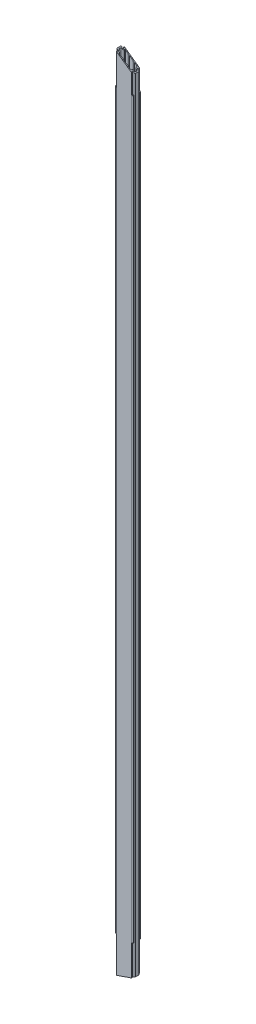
ISO-10303-21;
HEADER;
FILE_DESCRIPTION(('STEP AP214'),'2;1');
FILE_NAME('part.step','',(''),(''),'','','');
FILE_SCHEMA(('AUTOMOTIVE_DESIGN { 1 0 10303 214 1 1 1 1 }'));
ENDSEC;
DATA;
#1=APPLICATION_CONTEXT('core data for automotive mechanical design processes');
#2=APPLICATION_PROTOCOL_DEFINITION('international standard','automotive_design',2000,#1);
#3=PRODUCT_CONTEXT('',#1,'mechanical');
#4=PRODUCT('Part','Part','',(#3));
#5=PRODUCT_RELATED_PRODUCT_CATEGORY('part','',(#4));
#6=PRODUCT_DEFINITION_FORMATION('','',#4);
#7=PRODUCT_DEFINITION_CONTEXT('part definition',#1,'design');
#8=PRODUCT_DEFINITION('design','',#6,#7);
#9=PRODUCT_DEFINITION_SHAPE('','',#8);
#10=(LENGTH_UNIT() NAMED_UNIT(*) SI_UNIT(.MILLI.,.METRE.));
#11=(NAMED_UNIT(*) PLANE_ANGLE_UNIT() SI_UNIT($,.RADIAN.));
#12=(NAMED_UNIT(*) SI_UNIT($,.STERADIAN.) SOLID_ANGLE_UNIT());
#13=UNCERTAINTY_MEASURE_WITH_UNIT(LENGTH_MEASURE(1.E-05),#10,'distance_accuracy_value','');
#14=(GEOMETRIC_REPRESENTATION_CONTEXT(3) GLOBAL_UNCERTAINTY_ASSIGNED_CONTEXT((#13)) GLOBAL_UNIT_ASSIGNED_CONTEXT((#10,
#11,#12)) REPRESENTATION_CONTEXT('',''));
#15=CARTESIAN_POINT('',(0.,0.,0.));
#16=DIRECTION('',(0.,0.,1.));
#17=DIRECTION('',(1.,0.,0.));
#18=AXIS2_PLACEMENT_3D('',#15,#16,#17);
#19=CARTESIAN_POINT('',(84.6938611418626,7940.,-30.5717765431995));
#20=DIRECTION('',(0.,-1.,0.));
#21=DIRECTION('',(0.,0.,-1.));
#22=AXIS2_PLACEMENT_3D('',#19,#20,#21);
#23=CYLINDRICAL_SURFACE('',#22,3.99999999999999);
#24=CARTESIAN_POINT('',(84.6938611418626,360.561473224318,-30.5717765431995));
#25=DIRECTION('',(0.327547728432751,-0.9448346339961,0.));
#26=DIRECTION('',(-0.9448346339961,-0.327547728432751,0.));
#27=AXIS2_PLACEMENT_3D('',#24,#25,#26);
#28=ELLIPSE('',#27,4.23354506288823,3.99999999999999);
#29=CARTESIAN_POINT('',(88.1962844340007,361.775665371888,-32.5038818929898));
#30=VERTEX_POINT('',#29);
#31=CARTESIAN_POINT('',(81.1914378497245,359.347281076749,-28.6396711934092));
#32=VERTEX_POINT('',#31);
#33=EDGE_CURVE('E60',#30,#32,#28,.T.);
#34=ORIENTED_EDGE('',*,*,#33,.F.);
#35=DIRECTION('',(0.,-1.,0.));
#36=VECTOR('',#35,1.);
#37=CARTESIAN_POINT('',(88.1962844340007,7940.,-32.5038818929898));
#38=LINE('',#37,#36);
#39=CARTESIAN_POINT('',(88.1962844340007,7623.17516532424,-32.5038818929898));
#40=VERTEX_POINT('',#39);
#41=EDGE_CURVE('E511',#40,#30,#38,.T.);
#42=ORIENTED_EDGE('',*,*,#41,.F.);
#43=CARTESIAN_POINT('',(84.6938611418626,7625.66788988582,-30.5717765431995));
#44=DIRECTION('',(0.579850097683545,0.814723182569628,0.));
#45=DIRECTION('',(0.814723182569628,-0.579850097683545,0.));
#46=AXIS2_PLACEMENT_3D('',#43,#44,#45);
#47=ELLIPSE('',#46,4.90964303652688,3.99999999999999);
#48=CARTESIAN_POINT('',(81.1914378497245,7628.16061444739,-28.6396711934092));
#49=VERTEX_POINT('',#48);
#50=EDGE_CURVE('E882',#49,#40,#47,.T.);
#51=ORIENTED_EDGE('',*,*,#50,.F.);
#52=DIRECTION('',(0.,-1.,0.));
#53=VECTOR('',#52,1.);
#54=CARTESIAN_POINT('',(81.1914378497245,7940.,-28.6396711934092));
#55=LINE('',#54,#53);
#56=EDGE_CURVE('E569',#49,#32,#55,.T.);
#57=ORIENTED_EDGE('',*,*,#56,.T.);
#58=EDGE_LOOP('',(#34,#42,#51,#57));
#59=FACE_BOUND('',#58,.T.);
#60=ADVANCED_FACE('F38',(#59),#23,.T.);
#61=CARTESIAN_POINT('',(75.5,7940.,-25.5));
#62=DIRECTION('',(0.,-1.,0.));
#63=DIRECTION('',(0.,0.,-1.));
#64=AXIS2_PLACEMENT_3D('',#61,#62,#63);
#65=CYLINDRICAL_SURFACE('',#64,14.5);
#66=CARTESIAN_POINT('',(75.5,357.374218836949,-25.5));
#67=DIRECTION('',(0.327547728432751,-0.9448346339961,0.));
#68=DIRECTION('',(-0.9448346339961,-0.327547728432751,0.));
#69=AXIS2_PLACEMENT_3D('',#66,#67,#68);
#70=ELLIPSE('',#69,15.3466008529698,14.5);
#71=CARTESIAN_POINT('',(75.5,357.374218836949,-40.));
#72=VERTEX_POINT('',#71);
#73=EDGE_CURVE('E551',#72,#30,#70,.T.);
#74=ORIENTED_EDGE('',*,*,#73,.F.);
#75=DIRECTION('',(0.,-1.,0.));
#76=VECTOR('',#75,1.);
#77=CARTESIAN_POINT('',(75.5,7940.,-40.));
#78=LINE('',#77,#76);
#79=CARTESIAN_POINT('',(75.4999999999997,7632.21129185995,-40.));
#80=VERTEX_POINT('',#79);
#81=EDGE_CURVE('E507',#80,#72,#78,.T.);
#82=ORIENTED_EDGE('',*,*,#81,.F.);
#83=CARTESIAN_POINT('',(75.5,7632.21129185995,-25.5));
#84=DIRECTION('',(0.579850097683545,0.814723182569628,0.));
#85=DIRECTION('',(0.814723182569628,-0.579850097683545,0.));
#86=AXIS2_PLACEMENT_3D('',#83,#84,#85);
#87=ELLIPSE('',#86,17.79745600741,14.5);
#88=EDGE_CURVE('E880',#40,#80,#87,.T.);
#89=ORIENTED_EDGE('',*,*,#88,.F.);
#90=ORIENTED_EDGE('',*,*,#41,.T.);
#91=EDGE_LOOP('',(#74,#82,#89,#90));
#92=FACE_BOUND('',#91,.T.);
#93=ADVANCED_FACE('F961',(#92),#65,.T.);
#94=CARTESIAN_POINT('',(75.5,7940.,25.5));
#95=DIRECTION('',(0.,-1.,0.));
#96=DIRECTION('',(0.,0.,-1.));
#97=AXIS2_PLACEMENT_3D('',#94,#95,#96);
#98=CYLINDRICAL_SURFACE('',#97,14.5);
#99=CARTESIAN_POINT('',(75.5,357.374218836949,25.5));
#100=DIRECTION('',(0.327547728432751,-0.9448346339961,0.));
#101=DIRECTION('',(-0.9448346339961,-0.327547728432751,0.));
#102=AXIS2_PLACEMENT_3D('',#99,#100,#101);
#103=ELLIPSE('',#102,15.3466008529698,14.5);
#104=CARTESIAN_POINT('',(88.1962844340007,361.775665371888,32.5038818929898));
#105=VERTEX_POINT('',#104);
#106=CARTESIAN_POINT('',(75.5,357.374218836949,40.));
#107=VERTEX_POINT('',#106);
#108=EDGE_CURVE('E436',#105,#107,#103,.T.);
#109=ORIENTED_EDGE('',*,*,#108,.F.);
#110=DIRECTION('',(0.,-1.,0.));
#111=VECTOR('',#110,1.);
#112=CARTESIAN_POINT('',(88.1962844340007,7940.,32.5038818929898));
#113=LINE('',#112,#111);
#114=CARTESIAN_POINT('',(88.1962844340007,7623.17516532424,32.5038818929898));
#115=VERTEX_POINT('',#114);
#116=EDGE_CURVE('E469',#115,#105,#113,.T.);
#117=ORIENTED_EDGE('',*,*,#116,.F.);
#118=CARTESIAN_POINT('',(75.5,7632.21129185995,25.5));
#119=DIRECTION('',(0.579850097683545,0.814723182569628,0.));
#120=DIRECTION('',(0.814723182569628,-0.579850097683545,0.));
#121=AXIS2_PLACEMENT_3D('',#118,#119,#120);
#122=ELLIPSE('',#121,17.79745600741,14.5);
#123=CARTESIAN_POINT('',(75.4999999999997,7632.21129185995,40.));
#124=VERTEX_POINT('',#123);
#125=EDGE_CURVE('E467',#124,#115,#122,.T.);
#126=ORIENTED_EDGE('',*,*,#125,.F.);
#127=DIRECTION('',(0.,-1.,0.));
#128=VECTOR('',#127,1.);
#129=CARTESIAN_POINT('',(75.5,7940.,40.));
#130=LINE('',#129,#128);
#131=EDGE_CURVE('E460',#124,#107,#130,.T.);
#132=ORIENTED_EDGE('',*,*,#131,.T.);
#133=EDGE_LOOP('',(#109,#117,#126,#132));
#134=FACE_BOUND('',#133,.T.);
#135=ADVANCED_FACE('F466',(#134),#98,.T.);
#136=CARTESIAN_POINT('',(84.6938611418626,7940.,30.5717765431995));
#137=DIRECTION('',(0.,-1.,0.));
#138=DIRECTION('',(0.,0.,-1.));
#139=AXIS2_PLACEMENT_3D('',#136,#137,#138);
#140=CYLINDRICAL_SURFACE('',#139,3.99999999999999);
#141=CARTESIAN_POINT('',(84.6938611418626,360.561473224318,30.5717765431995));
#142=DIRECTION('',(0.327547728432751,-0.9448346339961,0.));
#143=DIRECTION('',(-0.9448346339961,-0.327547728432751,0.));
#144=AXIS2_PLACEMENT_3D('',#141,#142,#143);
#145=ELLIPSE('',#144,4.23354506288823,3.99999999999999);
#146=CARTESIAN_POINT('',(81.1914378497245,359.347281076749,28.6396711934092));
#147=VERTEX_POINT('',#146);
#148=EDGE_CURVE('E439',#147,#105,#145,.T.);
#149=ORIENTED_EDGE('',*,*,#148,.F.);
#150=DIRECTION('',(0.,-1.,0.));
#151=VECTOR('',#150,1.);
#152=CARTESIAN_POINT('',(81.1914378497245,7940.,28.6396711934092));
#153=LINE('',#152,#151);
#154=CARTESIAN_POINT('',(81.1914378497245,7628.16061444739,28.6396711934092));
#155=VERTEX_POINT('',#154);
#156=EDGE_CURVE('E473',#155,#147,#153,.T.);
#157=ORIENTED_EDGE('',*,*,#156,.F.);
#158=CARTESIAN_POINT('',(84.6938611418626,7625.66788988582,30.5717765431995));
#159=DIRECTION('',(0.579850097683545,0.814723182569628,0.));
#160=DIRECTION('',(0.814723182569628,-0.579850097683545,0.));
#161=AXIS2_PLACEMENT_3D('',#158,#159,#160);
#162=ELLIPSE('',#161,4.90964303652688,3.99999999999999);
#163=EDGE_CURVE('E878',#115,#155,#162,.T.);
#164=ORIENTED_EDGE('',*,*,#163,.F.);
#165=ORIENTED_EDGE('',*,*,#116,.T.);
#166=EDGE_LOOP('',(#149,#157,#164,#165));
#167=FACE_BOUND('',#166,.T.);
#168=ADVANCED_FACE('F549',(#167),#140,.T.);
#169=CARTESIAN_POINT('',(-84.6938611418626,7940.,30.5717765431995));
#170=DIRECTION('',(0.,-1.,0.));
#171=DIRECTION('',(0.,0.,-1.));
#172=AXIS2_PLACEMENT_3D('',#169,#170,#171);
#173=CYLINDRICAL_SURFACE('',#172,3.99999999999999);
#174=CARTESIAN_POINT('',(-84.6938611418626,360.,30.5717765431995));
#175=DIRECTION('',(0.,-1.,0.));
#176=DIRECTION('',(0.,0.,-1.));
#177=AXIS2_PLACEMENT_3D('',#174,#175,#176);
#178=CIRCLE('',#177,3.99999999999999);
#179=CARTESIAN_POINT('',(-88.1962844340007,360.,32.5038818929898));
#180=VERTEX_POINT('',#179);
#181=CARTESIAN_POINT('',(-81.1914378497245,360.,28.6396711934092));
#182=VERTEX_POINT('',#181);
#183=EDGE_CURVE('E904',#180,#182,#178,.T.);
#184=ORIENTED_EDGE('',*,*,#183,.F.);
#185=DIRECTION('',(0.,-1.,0.));
#186=VECTOR('',#185,1.);
#187=CARTESIAN_POINT('',(-88.1962844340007,7940.,32.5038818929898));
#188=LINE('',#187,#186);
#189=CARTESIAN_POINT('',(-88.1962844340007,7628.71626993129,32.5038818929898));
#190=VERTEX_POINT('',#189);
#191=EDGE_CURVE('E479',#190,#180,#188,.T.);
#192=ORIENTED_EDGE('',*,*,#191,.F.);
#193=CARTESIAN_POINT('',(-84.6938611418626,7626.22354536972,30.5717765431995));
#194=DIRECTION('',(0.579850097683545,0.814723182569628,0.));
#195=DIRECTION('',(0.814723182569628,-0.579850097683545,0.));
#196=AXIS2_PLACEMENT_3D('',#193,#194,#195);
#197=ELLIPSE('',#196,4.90964303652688,3.99999999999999);
#198=CARTESIAN_POINT('',(-81.1914378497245,7623.73082080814,28.6396711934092));
#199=VERTEX_POINT('',#198);
#200=EDGE_CURVE('E862',#199,#190,#197,.T.);
#201=ORIENTED_EDGE('',*,*,#200,.F.);
#202=DIRECTION('',(0.,-1.,0.));
#203=VECTOR('',#202,1.);
#204=CARTESIAN_POINT('',(-81.1914378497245,7940.,28.6396711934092));
#205=LINE('',#204,#203);
#206=EDGE_CURVE('E482',#199,#182,#205,.T.);
#207=ORIENTED_EDGE('',*,*,#206,.T.);
#208=EDGE_LOOP('',(#184,#192,#201,#207));
#209=FACE_BOUND('',#208,.T.);
#210=ADVANCED_FACE('F1041',(#209),#173,.T.);
#211=CARTESIAN_POINT('',(-75.5,7940.,25.5));
#212=DIRECTION('',(0.,-1.,0.));
#213=DIRECTION('',(0.,0.,-1.));
#214=AXIS2_PLACEMENT_3D('',#211,#212,#213);
#215=CYLINDRICAL_SURFACE('',#214,14.5);
#216=CARTESIAN_POINT('',(-75.5,360.,25.5));
#217=DIRECTION('',(0.,-1.,0.));
#218=DIRECTION('',(0.,0.,-1.));
#219=AXIS2_PLACEMENT_3D('',#216,#217,#218);
#220=CIRCLE('',#219,14.5);
#221=CARTESIAN_POINT('',(-75.5,360.,40.));
#222=VERTEX_POINT('',#221);
#223=EDGE_CURVE('E902',#222,#180,#220,.T.);
#224=ORIENTED_EDGE('',*,*,#223,.F.);
#225=DIRECTION('',(0.,-1.,0.));
#226=VECTOR('',#225,1.);
#227=CARTESIAN_POINT('',(-75.5,7940.,40.));
#228=LINE('',#227,#226);
#229=CARTESIAN_POINT('',(-75.5,7619.68014339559,40.));
#230=VERTEX_POINT('',#229);
#231=EDGE_CURVE('E472',#230,#222,#228,.T.);
#232=ORIENTED_EDGE('',*,*,#231,.F.);
#233=CARTESIAN_POINT('',(-75.5,7619.68014339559,25.5));
#234=DIRECTION('',(0.579850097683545,0.814723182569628,0.));
#235=DIRECTION('',(0.814723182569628,-0.579850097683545,0.));
#236=AXIS2_PLACEMENT_3D('',#233,#234,#235);
#237=ELLIPSE('',#236,17.79745600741,14.5);
#238=EDGE_CURVE('E521',#190,#230,#237,.T.);
#239=ORIENTED_EDGE('',*,*,#238,.F.);
#240=ORIENTED_EDGE('',*,*,#191,.T.);
#241=EDGE_LOOP('',(#224,#232,#239,#240));
#242=FACE_BOUND('',#241,.T.);
#243=ADVANCED_FACE('F1033',(#242),#215,.T.);
#244=CARTESIAN_POINT('',(-75.5,7940.,-25.5));
#245=DIRECTION('',(0.,-1.,0.));
#246=DIRECTION('',(0.,0.,-1.));
#247=AXIS2_PLACEMENT_3D('',#244,#245,#246);
#248=CYLINDRICAL_SURFACE('',#247,6.5);
#249=DIRECTION('',(0.,-1.,0.));
#250=VECTOR('',#249,1.);
#251=CARTESIAN_POINT('',(-75.5,7940.,-32.));
#252=LINE('',#251,#250);
#253=CARTESIAN_POINT('',(-75.5,5.0267442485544,-32.));
#254=VERTEX_POINT('',#253);
#255=CARTESIAN_POINT('',(-75.5,360.,-32.));
#256=VERTEX_POINT('',#255);
#257=EDGE_CURVE('E908',#254,#256,#252,.F.);
#258=ORIENTED_EDGE('',*,*,#257,.F.);
#259=CARTESIAN_POINT('',(-75.5,5.02674424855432,-25.5));
#260=DIRECTION('',(-0.327547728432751,0.9448346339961,0.));
#261=DIRECTION('',(-0.9448346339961,-0.327547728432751,0.));
#262=AXIS2_PLACEMENT_3D('',#259,#260,#261);
#263=ELLIPSE('',#262,6.87951072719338,6.5);
#264=CARTESIAN_POINT('',(-79.7220192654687,3.56308831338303,-20.5578796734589));
#265=VERTEX_POINT('',#264);
#266=EDGE_CURVE('E764',#254,#265,#263,.F.);
#267=ORIENTED_EDGE('',*,*,#266,.T.);
#268=DIRECTION('',(0.,-1.,0.));
#269=VECTOR('',#268,1.);
#270=CARTESIAN_POINT('',(-79.7220192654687,7940.,-20.5578796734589));
#271=LINE('',#270,#269);
#272=CARTESIAN_POINT('',(-79.7220192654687,7932.6850146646,-20.5578796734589));
#273=VERTEX_POINT('',#272);
#274=EDGE_CURVE('E494',#273,#265,#271,.T.);
#275=ORIENTED_EDGE('',*,*,#274,.F.);
#276=CARTESIAN_POINT('',(-75.5,7929.68014339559,-25.5));
#277=DIRECTION('',(-0.579850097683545,-0.814723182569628,0.));
#278=DIRECTION('',(0.814723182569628,-0.579850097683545,0.));
#279=AXIS2_PLACEMENT_3D('',#276,#277,#278);
#280=ELLIPSE('',#279,7.9781699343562,6.5);
#281=CARTESIAN_POINT('',(-75.5,7929.68014339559,-32.));
#282=VERTEX_POINT('',#281);
#283=EDGE_CURVE('E673',#273,#282,#280,.F.);
#284=ORIENTED_EDGE('',*,*,#283,.T.);
#285=DIRECTION('',(0.,-1.,0.));
#286=VECTOR('',#285,1.);
#287=CARTESIAN_POINT('',(-75.5,7940.,-32.));
#288=LINE('',#287,#286);
#289=CARTESIAN_POINT('',(-75.5,7619.68014339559,-32.));
#290=VERTEX_POINT('',#289);
#291=EDGE_CURVE('E864',#282,#290,#288,.T.);
#292=ORIENTED_EDGE('',*,*,#291,.T.);
#293=CARTESIAN_POINT('',(-75.5,7619.68014339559,-25.5));
#294=DIRECTION('',(0.579850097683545,0.814723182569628,0.));
#295=DIRECTION('',(0.814723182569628,-0.579850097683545,0.));
#296=AXIS2_PLACEMENT_3D('',#293,#294,#295);
#297=ELLIPSE('',#296,7.9781699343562,6.5);
#298=CARTESIAN_POINT('',(-81.1914378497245,7623.73082080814,-28.6396711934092));
#299=VERTEX_POINT('',#298);
#300=EDGE_CURVE('E523',#299,#290,#297,.F.);
#301=ORIENTED_EDGE('',*,*,#300,.F.);
#302=DIRECTION('',(0.,-1.,0.));
#303=VECTOR('',#302,1.);
#304=CARTESIAN_POINT('',(-81.1914378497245,7940.,-28.6396711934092));
#305=LINE('',#304,#303);
#306=CARTESIAN_POINT('',(-81.1914378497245,360.,-28.6396711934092));
#307=VERTEX_POINT('',#306);
#308=EDGE_CURVE('E497',#299,#307,#305,.T.);
#309=ORIENTED_EDGE('',*,*,#308,.T.);
#310=CARTESIAN_POINT('',(-75.5,360.,-25.5));
#311=DIRECTION('',(0.,1.,0.));
#312=DIRECTION('',(0.,0.,1.));
#313=AXIS2_PLACEMENT_3D('',#310,#311,#312);
#314=CIRCLE('',#313,6.5);
#315=EDGE_CURVE('E538',#307,#256,#314,.F.);
#316=ORIENTED_EDGE('',*,*,#315,.T.);
#317=EDGE_LOOP('',(#258,#267,#275,#284,#292,#301,#309,#316));
#318=FACE_BOUND('',#317,.T.);
#319=ADVANCED_FACE('F1003',(#318),#248,.F.);
#320=CARTESIAN_POINT('',(-75.5,7940.,25.5));
#321=DIRECTION('',(0.,-1.,0.));
#322=DIRECTION('',(0.,0.,-1.));
#323=AXIS2_PLACEMENT_3D('',#320,#321,#322);
#324=CYLINDRICAL_SURFACE('',#323,6.5);
#325=DIRECTION('',(0.,-1.,0.));
#326=VECTOR('',#325,1.);
#327=CARTESIAN_POINT('',(-75.5,7940.,32.));
#328=LINE('',#327,#326);
#329=CARTESIAN_POINT('',(-75.5,360.,32.));
#330=VERTEX_POINT('',#329);
#331=CARTESIAN_POINT('',(-75.5,5.02674424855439,32.));
#332=VERTEX_POINT('',#331);
#333=EDGE_CURVE('E906',#330,#332,#328,.T.);
#334=ORIENTED_EDGE('',*,*,#333,.F.);
#335=CARTESIAN_POINT('',(-75.5,360.,25.5));
#336=DIRECTION('',(0.,-1.,0.));
#337=DIRECTION('',(0.,0.,-1.));
#338=AXIS2_PLACEMENT_3D('',#335,#336,#337);
#339=CIRCLE('',#338,6.5);
#340=EDGE_CURVE('E536',#182,#330,#339,.F.);
#341=ORIENTED_EDGE('',*,*,#340,.F.);
#342=ORIENTED_EDGE('',*,*,#206,.F.);
#343=CARTESIAN_POINT('',(-75.5,7619.68014339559,25.5));
#344=DIRECTION('',(0.579850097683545,0.814723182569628,0.));
#345=DIRECTION('',(0.814723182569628,-0.579850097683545,0.));
#346=AXIS2_PLACEMENT_3D('',#343,#344,#345);
#347=ELLIPSE('',#346,7.9781699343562,6.5);
#348=CARTESIAN_POINT('',(-75.5,7619.68014339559,32.));
#349=VERTEX_POINT('',#348);
#350=EDGE_CURVE('E860',#349,#199,#347,.F.);
#351=ORIENTED_EDGE('',*,*,#350,.F.);
#352=DIRECTION('',(0.,-1.,0.));
#353=VECTOR('',#352,1.);
#354=CARTESIAN_POINT('',(-75.5,7940.,32.));
#355=LINE('',#354,#353);
#356=CARTESIAN_POINT('',(-75.5,7929.68014339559,32.));
#357=VERTEX_POINT('',#356);
#358=EDGE_CURVE('E867',#349,#357,#355,.F.);
#359=ORIENTED_EDGE('',*,*,#358,.T.);
#360=CARTESIAN_POINT('',(-75.5,7929.68014339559,25.5));
#361=DIRECTION('',(-0.579850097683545,-0.814723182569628,0.));
#362=DIRECTION('',(0.814723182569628,-0.579850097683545,0.));
#363=AXIS2_PLACEMENT_3D('',#360,#361,#362);
#364=ELLIPSE('',#363,7.9781699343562,6.5);
#365=CARTESIAN_POINT('',(-79.7220192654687,7932.6850146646,20.5578796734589));
#366=VERTEX_POINT('',#365);
#367=EDGE_CURVE('E682',#357,#366,#364,.F.);
#368=ORIENTED_EDGE('',*,*,#367,.T.);
#369=DIRECTION('',(0.,-1.,0.));
#370=VECTOR('',#369,1.);
#371=CARTESIAN_POINT('',(-79.7220192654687,7940.,20.5578796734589));
#372=LINE('',#371,#370);
#373=CARTESIAN_POINT('',(-79.7220192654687,3.56308831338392,20.5578796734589));
#374=VERTEX_POINT('',#373);
#375=EDGE_CURVE('E485',#366,#374,#372,.T.);
#376=ORIENTED_EDGE('',*,*,#375,.T.);
#377=CARTESIAN_POINT('',(-75.5,5.02674424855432,25.5));
#378=DIRECTION('',(-0.327547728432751,0.9448346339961,0.));
#379=DIRECTION('',(-0.9448346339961,-0.327547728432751,0.));
#380=AXIS2_PLACEMENT_3D('',#377,#378,#379);
#381=ELLIPSE('',#380,6.87951072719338,6.5);
#382=EDGE_CURVE('E774',#374,#332,#381,.F.);
#383=ORIENTED_EDGE('',*,*,#382,.T.);
#384=EDGE_LOOP('',(#334,#341,#342,#351,#359,#368,#376,#383));
#385=FACE_BOUND('',#384,.T.);
#386=ADVANCED_FACE('F1022',(#385),#324,.F.);
#387=CARTESIAN_POINT('',(90.,62.4009630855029,-40.));
#388=DIRECTION('',(-0.327547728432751,0.9448346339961,0.));
#389=DIRECTION('',(-0.9448346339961,-0.327547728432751,0.));
#390=AXIS2_PLACEMENT_3D('',#387,#388,#389);
#391=PLANE('',#390);
#392=CARTESIAN_POINT('',(75.5,57.3742188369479,-25.5));
#393=DIRECTION('',(-0.327547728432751,0.9448346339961,0.));
#394=DIRECTION('',(-0.9448346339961,-0.327547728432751,0.));
#395=AXIS2_PLACEMENT_3D('',#392,#393,#394);
#396=ELLIPSE('',#395,15.3466008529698,14.5);
#397=CARTESIAN_POINT('',(75.5,57.3742188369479,-11.));
#398=VERTEX_POINT('',#397);
#399=CARTESIAN_POINT('',(61.,52.3474745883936,-25.5));
#400=VERTEX_POINT('',#399);
#401=EDGE_CURVE('E788',#398,#400,#396,.F.);
#402=ORIENTED_EDGE('',*,*,#401,.T.);
#403=CARTESIAN_POINT('',(54.5,50.0941064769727,-25.5));
#404=DIRECTION('',(-0.327547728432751,0.9448346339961,0.));
#405=DIRECTION('',(-0.9448346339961,-0.327547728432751,0.));
#406=AXIS2_PLACEMENT_3D('',#403,#404,#405);
#407=ELLIPSE('',#406,6.87951072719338,6.5);
#408=CARTESIAN_POINT('',(54.5,50.0941064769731,-32.));
#409=VERTEX_POINT('',#408);
#410=EDGE_CURVE('E790',#400,#409,#407,.T.);
#411=ORIENTED_EDGE('',*,*,#410,.T.);
#412=DIRECTION('',(-0.9448346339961,-0.327547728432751,0.));
#413=VECTOR('',#412,1.);
#414=CARTESIAN_POINT('',(2476.63152101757,889.779326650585,-32.0000000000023));
#415=LINE('',#414,#413);
#416=CARTESIAN_POINT('',(32.5172988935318,42.4733191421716,-31.9999999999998));
#417=VERTEX_POINT('',#416);
#418=EDGE_CURVE('E792',#409,#417,#415,.T.);
#419=ORIENTED_EDGE('',*,*,#418,.T.);
#420=DIRECTION('',(-0.627399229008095,-0.217501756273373,0.747705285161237));
#421=VECTOR('',#420,1.);
#422=CARTESIAN_POINT('',(1107.8190058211,415.250330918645,-1313.49467235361));
#423=LINE('',#422,#421);
#424=CARTESIAN_POINT('',(29.9999999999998,41.6006420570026,-29.));
#425=VERTEX_POINT('',#424);
#426=EDGE_CURVE('E794',#417,#425,#423,.T.);
#427=ORIENTED_EDGE('',*,*,#426,.T.);
#428=DIRECTION('',(-0.9448346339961,-0.327547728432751,0.));
#429=VECTOR('',#428,1.);
#430=CARTESIAN_POINT('',(2465.45717200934,885.905492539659,-28.9999999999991));
#431=LINE('',#430,#429);
#432=CARTESIAN_POINT('',(20.,38.1339218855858,-29.0000000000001));
#433=VERTEX_POINT('',#432);
#434=EDGE_CURVE('E796',#425,#433,#431,.T.);
#435=ORIENTED_EDGE('',*,*,#434,.T.);
#436=DIRECTION('',(-0.6273992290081,-0.217501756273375,-0.747705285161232));
#437=VECTOR('',#436,1.);
#438=CARTESIAN_POINT('',(1098.29207596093,411.947610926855,1256.0584553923));
#439=LINE('',#438,#437);
#440=CARTESIAN_POINT('',(17.4827011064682,37.2612448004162,-32.));
#441=VERTEX_POINT('',#440);
#442=EDGE_CURVE('E798',#433,#441,#439,.T.);
#443=ORIENTED_EDGE('',*,*,#442,.T.);
#444=DIRECTION('',(-0.9448346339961,-0.327547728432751,0.));
#445=VECTOR('',#444,1.);
#446=CARTESIAN_POINT('',(2431.99589673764,874.305404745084,-32.0000000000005));
#447=LINE('',#446,#445);
#448=CARTESIAN_POINT('',(-17.4827011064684,25.1397182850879,-31.9999999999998));
#449=VERTEX_POINT('',#448);
#450=EDGE_CURVE('E800',#441,#449,#447,.T.);
#451=ORIENTED_EDGE('',*,*,#450,.T.);
#452=DIRECTION('',(-0.6273992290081,-0.217501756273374,0.747705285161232));
#453=VECTOR('',#452,1.);
#454=CARTESIAN_POINT('',(1060.18435652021,398.736730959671,-1316.31358754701));
#455=LINE('',#454,#453);
#456=CARTESIAN_POINT('',(-20.,24.2670411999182,-29.));
#457=VERTEX_POINT('',#456);
#458=EDGE_CURVE('E802',#449,#457,#455,.T.);
#459=ORIENTED_EDGE('',*,*,#458,.T.);
#460=DIRECTION('',(-0.9448346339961,-0.327547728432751,0.));
#461=VECTOR('',#460,1.);
#462=CARTESIAN_POINT('',(2429.7486725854,873.526355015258,-29.));
#463=LINE('',#462,#461);
#464=CARTESIAN_POINT('',(-30.0000000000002,20.8003210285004,-29.0000000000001));
#465=VERTEX_POINT('',#464);
#466=EDGE_CURVE('E804',#457,#465,#463,.T.);
#467=ORIENTED_EDGE('',*,*,#466,.T.);
#468=DIRECTION('',(-0.627399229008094,-0.217501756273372,-0.747705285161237));
#469=VECTOR('',#468,1.);
#470=CARTESIAN_POINT('',(1050.65742666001,395.434010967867,1258.87737058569));
#471=LINE('',#470,#469);
#472=CARTESIAN_POINT('',(-32.5172988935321,19.9276439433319,-32.));
#473=VERTEX_POINT('',#472);
#474=EDGE_CURVE('E806',#465,#473,#471,.T.);
#475=ORIENTED_EDGE('',*,*,#474,.T.);
#476=DIRECTION('',(-0.9448346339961,-0.327547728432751,0.));
#477=VECTOR('',#476,1.);
#478=CARTESIAN_POINT('',(2418.57432357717,869.652520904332,-31.9999999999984));
#479=LINE('',#478,#477);
#480=CARTESIAN_POINT('',(-54.5,12.3068566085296,-32.));
#481=VERTEX_POINT('',#480);
#482=EDGE_CURVE('E808',#473,#481,#479,.T.);
#483=ORIENTED_EDGE('',*,*,#482,.T.);
#484=CARTESIAN_POINT('',(-54.5,12.3068566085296,-25.5));
#485=DIRECTION('',(-0.327547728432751,0.9448346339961,0.));
#486=DIRECTION('',(-0.9448346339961,-0.327547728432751,0.));
#487=AXIS2_PLACEMENT_3D('',#484,#485,#486);
#488=ELLIPSE('',#487,6.87951072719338,6.5);
#489=CARTESIAN_POINT('',(-61.,10.0534884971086,-25.5));
#490=VERTEX_POINT('',#489);
#491=EDGE_CURVE('E810',#481,#490,#488,.T.);
#492=ORIENTED_EDGE('',*,*,#491,.T.);
#493=CARTESIAN_POINT('',(-75.5,5.02674424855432,-25.5));
#494=DIRECTION('',(-0.327547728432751,0.9448346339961,0.));
#495=DIRECTION('',(-0.9448346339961,-0.327547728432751,0.));
#496=AXIS2_PLACEMENT_3D('',#493,#494,#495);
#497=ELLIPSE('',#496,15.3466008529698,14.5);
#498=CARTESIAN_POINT('',(-75.5,5.02674424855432,-11.));
#499=VERTEX_POINT('',#498);
#500=EDGE_CURVE('E812',#490,#499,#497,.F.);
#501=ORIENTED_EDGE('',*,*,#500,.T.);
#502=CARTESIAN_POINT('',(-75.5,5.02674424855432,-4.5));
#503=DIRECTION('',(-0.327547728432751,0.9448346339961,0.));
#504=DIRECTION('',(-0.9448346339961,-0.327547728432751,0.));
#505=AXIS2_PLACEMENT_3D('',#502,#503,#504);
#506=ELLIPSE('',#505,6.87951072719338,6.5);
#507=CARTESIAN_POINT('',(-82.,2.77337613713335,-4.5));
#508=VERTEX_POINT('',#507);
#509=EDGE_CURVE('E814',#499,#508,#506,.T.);
#510=ORIENTED_EDGE('',*,*,#509,.T.);
#511=DIRECTION('',(0.,0.,1.));
#512=VECTOR('',#511,1.);
#513=CARTESIAN_POINT('',(-82.,2.77337613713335,-4.5));
#514=LINE('',#513,#512);
#515=CARTESIAN_POINT('',(-82.,2.77337613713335,4.5));
#516=VERTEX_POINT('',#515);
#517=EDGE_CURVE('E816',#508,#516,#514,.T.);
#518=ORIENTED_EDGE('',*,*,#517,.T.);
#519=CARTESIAN_POINT('',(-75.5,5.02674424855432,4.5));
#520=DIRECTION('',(-0.327547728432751,0.9448346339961,0.));
#521=DIRECTION('',(-0.9448346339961,-0.327547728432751,0.));
#522=AXIS2_PLACEMENT_3D('',#519,#520,#521);
#523=ELLIPSE('',#522,6.87951072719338,6.5);
#524=CARTESIAN_POINT('',(-75.5,5.02674424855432,11.));
#525=VERTEX_POINT('',#524);
#526=EDGE_CURVE('E818',#516,#525,#523,.T.);
#527=ORIENTED_EDGE('',*,*,#526,.T.);
#528=CARTESIAN_POINT('',(-75.5,5.02674424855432,25.5));
#529=DIRECTION('',(-0.327547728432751,0.9448346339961,0.));
#530=DIRECTION('',(-0.9448346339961,-0.327547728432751,0.));
#531=AXIS2_PLACEMENT_3D('',#528,#529,#530);
#532=ELLIPSE('',#531,15.3466008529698,14.5);
#533=CARTESIAN_POINT('',(-61.,10.0534884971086,25.5));
#534=VERTEX_POINT('',#533);
#535=EDGE_CURVE('E820',#525,#534,#532,.F.);
#536=ORIENTED_EDGE('',*,*,#535,.T.);
#537=CARTESIAN_POINT('',(-54.5,12.3068566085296,25.5));
#538=DIRECTION('',(-0.327547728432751,0.9448346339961,0.));
#539=DIRECTION('',(-0.9448346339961,-0.327547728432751,0.));
#540=AXIS2_PLACEMENT_3D('',#537,#538,#539);
#541=ELLIPSE('',#540,6.87951072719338,6.5);
#542=CARTESIAN_POINT('',(-54.5,12.3068566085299,32.));
#543=VERTEX_POINT('',#542);
#544=EDGE_CURVE('E822',#534,#543,#541,.T.);
#545=ORIENTED_EDGE('',*,*,#544,.T.);
#546=DIRECTION('',(0.9448346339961,0.327547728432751,0.));
#547=VECTOR('',#546,1.);
#548=CARTESIAN_POINT('',(2418.57432357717,869.652520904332,31.9999999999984));
#549=LINE('',#548,#547);
#550=CARTESIAN_POINT('',(-32.5172988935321,19.9276439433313,31.9999999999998));
#551=VERTEX_POINT('',#550);
#552=EDGE_CURVE('E824',#543,#551,#549,.T.);
#553=ORIENTED_EDGE('',*,*,#552,.T.);
#554=DIRECTION('',(0.627399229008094,0.217501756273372,-0.747705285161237));
#555=VECTOR('',#554,1.);
#556=CARTESIAN_POINT('',(1050.65742666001,395.434010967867,-1258.87737058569));
#557=LINE('',#556,#555);
#558=CARTESIAN_POINT('',(-29.9999999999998,20.8003210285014,29.));
#559=VERTEX_POINT('',#558);
#560=EDGE_CURVE('E826',#551,#559,#557,.T.);
#561=ORIENTED_EDGE('',*,*,#560,.T.);
#562=DIRECTION('',(0.9448346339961,0.327547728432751,0.));
#563=VECTOR('',#562,1.);
#564=CARTESIAN_POINT('',(2429.7486725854,873.526355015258,29.));
#565=LINE('',#564,#563);
#566=CARTESIAN_POINT('',(-20.,24.2670411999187,29.0000000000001));
#567=VERTEX_POINT('',#566);
#568=EDGE_CURVE('E828',#559,#567,#565,.T.);
#569=ORIENTED_EDGE('',*,*,#568,.T.);
#570=DIRECTION('',(0.6273992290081,0.217501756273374,0.747705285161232));
#571=VECTOR('',#570,1.);
#572=CARTESIAN_POINT('',(1060.18435652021,398.736730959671,1316.31358754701));
#573=LINE('',#572,#571);
#574=CARTESIAN_POINT('',(-17.4827011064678,25.1397182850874,32.));
#575=VERTEX_POINT('',#574);
#576=EDGE_CURVE('E830',#567,#575,#573,.T.);
#577=ORIENTED_EDGE('',*,*,#576,.T.);
#578=DIRECTION('',(0.9448346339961,0.327547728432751,0.));
#579=VECTOR('',#578,1.);
#580=CARTESIAN_POINT('',(2431.99589673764,874.305404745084,32.0000000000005));
#581=LINE('',#580,#579);
#582=CARTESIAN_POINT('',(17.4827011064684,37.2612448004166,31.9999999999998));
#583=VERTEX_POINT('',#582);
#584=EDGE_CURVE('E832',#575,#583,#581,.T.);
#585=ORIENTED_EDGE('',*,*,#584,.T.);
#586=DIRECTION('',(0.6273992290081,0.217501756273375,-0.747705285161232));
#587=VECTOR('',#586,1.);
#588=CARTESIAN_POINT('',(1098.29207596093,411.947610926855,-1256.0584553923));
#589=LINE('',#588,#587);
#590=CARTESIAN_POINT('',(20.,38.1339218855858,29.));
#591=VERTEX_POINT('',#590);
#592=EDGE_CURVE('E834',#583,#591,#589,.T.);
#593=ORIENTED_EDGE('',*,*,#592,.T.);
#594=DIRECTION('',(0.9448346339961,0.327547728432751,0.));
#595=VECTOR('',#594,1.);
#596=CARTESIAN_POINT('',(2465.45717200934,885.905492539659,28.9999999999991));
#597=LINE('',#596,#595);
#598=CARTESIAN_POINT('',(30.,41.6006420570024,29.0000000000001));
#599=VERTEX_POINT('',#598);
#600=EDGE_CURVE('E836',#591,#599,#597,.T.);
#601=ORIENTED_EDGE('',*,*,#600,.T.);
#602=DIRECTION('',(0.627399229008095,0.217501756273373,0.747705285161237));
#603=VECTOR('',#602,1.);
#604=CARTESIAN_POINT('',(1107.8190058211,415.250330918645,1313.49467235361));
#605=LINE('',#604,#603);
#606=CARTESIAN_POINT('',(32.5172988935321,42.4733191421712,32.));
#607=VERTEX_POINT('',#606);
#608=EDGE_CURVE('E838',#599,#607,#605,.T.);
#609=ORIENTED_EDGE('',*,*,#608,.T.);
#610=DIRECTION('',(0.9448346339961,0.327547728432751,0.));
#611=VECTOR('',#610,1.);
#612=CARTESIAN_POINT('',(2476.63152101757,889.779326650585,32.0000000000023));
#613=LINE('',#612,#611);
#614=CARTESIAN_POINT('',(54.5,50.0941064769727,32.));
#615=VERTEX_POINT('',#614);
#616=EDGE_CURVE('E840',#607,#615,#613,.T.);
#617=ORIENTED_EDGE('',*,*,#616,.T.);
#618=CARTESIAN_POINT('',(54.5,50.0941064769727,25.5));
#619=DIRECTION('',(-0.327547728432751,0.9448346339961,0.));
#620=DIRECTION('',(-0.9448346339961,-0.327547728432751,0.));
#621=AXIS2_PLACEMENT_3D('',#618,#619,#620);
#622=ELLIPSE('',#621,6.87951072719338,6.5);
#623=CARTESIAN_POINT('',(61.,52.3474745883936,25.5));
#624=VERTEX_POINT('',#623);
#625=EDGE_CURVE('E842',#615,#624,#622,.T.);
#626=ORIENTED_EDGE('',*,*,#625,.T.);
#627=CARTESIAN_POINT('',(75.5,57.3742188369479,25.5));
#628=DIRECTION('',(-0.327547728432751,0.9448346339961,0.));
#629=DIRECTION('',(-0.9448346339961,-0.327547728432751,0.));
#630=AXIS2_PLACEMENT_3D('',#627,#628,#629);
#631=ELLIPSE('',#630,15.3466008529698,14.5);
#632=CARTESIAN_POINT('',(75.5,57.3742188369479,11.));
#633=VERTEX_POINT('',#632);
#634=EDGE_CURVE('E844',#624,#633,#631,.F.);
#635=ORIENTED_EDGE('',*,*,#634,.T.);
#636=CARTESIAN_POINT('',(75.5,57.3742188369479,4.5));
#637=DIRECTION('',(-0.327547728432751,0.9448346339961,0.));
#638=DIRECTION('',(-0.9448346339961,-0.327547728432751,0.));
#639=AXIS2_PLACEMENT_3D('',#636,#637,#638);
#640=ELLIPSE('',#639,6.87951072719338,6.5);
#641=CARTESIAN_POINT('',(82.,59.6275869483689,4.5));
#642=VERTEX_POINT('',#641);
#643=EDGE_CURVE('E846',#633,#642,#640,.T.);
#644=ORIENTED_EDGE('',*,*,#643,.T.);
#645=DIRECTION('',(0.,0.,-1.));
#646=VECTOR('',#645,1.);
#647=CARTESIAN_POINT('',(82.,59.6275869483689,-4.5));
#648=LINE('',#647,#646);
#649=CARTESIAN_POINT('',(82.,59.6275869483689,-4.5));
#650=VERTEX_POINT('',#649);
#651=EDGE_CURVE('E848',#642,#650,#648,.T.);
#652=ORIENTED_EDGE('',*,*,#651,.T.);
#653=CARTESIAN_POINT('',(75.5,57.3742188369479,-4.5));
#654=DIRECTION('',(-0.327547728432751,0.9448346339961,0.));
#655=DIRECTION('',(-0.9448346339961,-0.327547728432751,0.));
#656=AXIS2_PLACEMENT_3D('',#653,#654,#655);
#657=ELLIPSE('',#656,6.87951072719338,6.5);
#658=EDGE_CURVE('E516',#650,#398,#657,.T.);
#659=ORIENTED_EDGE('',*,*,#658,.T.);
#660=EDGE_LOOP('',(#402,#411,#419,#427,#435,#443,#451,#459,#467,#475,#483,#492,#501,#510,#518,
#527,#536,#545,#553,#561,#569,#577,#585,#593,#601,#609,#617,#626,#635,#644,#652,#659));
#661=FACE_BOUND('',#660,.T.);
#662=CARTESIAN_POINT('',(75.5,57.3742188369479,25.5));
#663=DIRECTION('',(-0.327547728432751,0.9448346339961,0.));
#664=DIRECTION('',(-0.9448346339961,-0.327547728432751,0.));
#665=AXIS2_PLACEMENT_3D('',#662,#663,#664);
#666=ELLIPSE('',#665,6.87951072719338,6.5);
#667=CARTESIAN_POINT('',(75.5,57.3742188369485,32.));
#668=VERTEX_POINT('',#667);
#669=CARTESIAN_POINT('',(79.7220192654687,58.8378747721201,20.5578796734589));
#670=VERTEX_POINT('',#669);
#671=EDGE_CURVE('E777',#668,#670,#666,.F.);
#672=ORIENTED_EDGE('',*,*,#671,.F.);
#673=DIRECTION('',(0.,0.,-1.));
#674=VECTOR('',#673,1.);
#675=CARTESIAN_POINT('',(75.5,57.3742188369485,-40.));
#676=LINE('',#675,#674);
#677=CARTESIAN_POINT('',(75.5,57.3742188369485,40.));
#678=VERTEX_POINT('',#677);
#679=EDGE_CURVE('E452',#678,#668,#676,.T.);
#680=ORIENTED_EDGE('',*,*,#679,.F.);
#681=DIRECTION('',(-0.9448346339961,-0.327547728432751,0.));
#682=VECTOR('',#681,1.);
#683=CARTESIAN_POINT('',(90.,62.4009630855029,40.));
#684=LINE('',#683,#682);
#685=CARTESIAN_POINT('',(-75.5,5.02674424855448,40.));
#686=VERTEX_POINT('',#685);
#687=EDGE_CURVE('E463',#678,#686,#684,.T.);
#688=ORIENTED_EDGE('',*,*,#687,.T.);
#689=DIRECTION('',(0.,0.,1.));
#690=VECTOR('',#689,1.);
#691=CARTESIAN_POINT('',(-75.4999999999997,5.02674424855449,-40.0000000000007));
#692=LINE('',#691,#690);
#693=EDGE_CURVE('E534',#332,#686,#692,.T.);
#694=ORIENTED_EDGE('',*,*,#693,.F.);
#695=ORIENTED_EDGE('',*,*,#382,.F.);
#696=CARTESIAN_POINT('',(-83.7691890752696,2.16004779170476,15.8204308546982));
#697=DIRECTION('',(-0.327547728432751,0.9448346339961,0.));
#698=DIRECTION('',(-0.9448346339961,-0.327547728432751,0.));
#699=AXIS2_PLACEMENT_3D('',#696,#697,#698);
#700=ELLIPSE('',#699,6.59460470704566,6.23081092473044);
#701=CARTESIAN_POINT('',(-90.,0.,15.8204308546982));
#702=VERTEX_POINT('',#701);
#703=EDGE_CURVE('E771',#702,#374,#700,.T.);
#704=ORIENTED_EDGE('',*,*,#703,.F.);
#705=DIRECTION('',(0.,0.,1.));
#706=VECTOR('',#705,1.);
#707=CARTESIAN_POINT('',(-90.,0.,15.8204308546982));
#708=LINE('',#707,#706);
#709=CARTESIAN_POINT('',(-90.,0.,-15.8204308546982));
#710=VERTEX_POINT('',#709);
#711=EDGE_CURVE('E573',#710,#702,#708,.T.);
#712=ORIENTED_EDGE('',*,*,#711,.F.);
#713=CARTESIAN_POINT('',(-83.7691890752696,2.16004779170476,-15.8204308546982));
#714=DIRECTION('',(-0.327547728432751,0.9448346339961,0.));
#715=DIRECTION('',(-0.9448346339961,-0.327547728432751,0.));
#716=AXIS2_PLACEMENT_3D('',#713,#714,#715);
#717=ELLIPSE('',#716,6.59460470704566,6.23081092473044);
#718=EDGE_CURVE('E768',#265,#710,#717,.T.);
#719=ORIENTED_EDGE('',*,*,#718,.F.);
#720=ORIENTED_EDGE('',*,*,#266,.F.);
#721=DIRECTION('',(0.,0.,1.));
#722=VECTOR('',#721,1.);
#723=CARTESIAN_POINT('',(-75.5,5.02674424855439,-39.9999999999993));
#724=LINE('',#723,#722);
#725=CARTESIAN_POINT('',(-75.5,5.02674424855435,-40.));
#726=VERTEX_POINT('',#725);
#727=EDGE_CURVE('E532',#726,#254,#724,.T.);
#728=ORIENTED_EDGE('',*,*,#727,.F.);
#729=DIRECTION('',(-0.9448346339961,-0.327547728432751,0.));
#730=VECTOR('',#729,1.);
#731=CARTESIAN_POINT('',(90.,62.4009630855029,-40.));
#732=LINE('',#731,#730);
#733=CARTESIAN_POINT('',(75.5,57.3742188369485,-40.));
#734=VERTEX_POINT('',#733);
#735=EDGE_CURVE('E852',#734,#726,#732,.T.);
#736=ORIENTED_EDGE('',*,*,#735,.F.);
#737=DIRECTION('',(0.,0.,-1.));
#738=VECTOR('',#737,1.);
#739=CARTESIAN_POINT('',(75.5,57.3742188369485,-40.));
#740=LINE('',#739,#738);
#741=CARTESIAN_POINT('',(75.5,57.3742188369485,-32.));
#742=VERTEX_POINT('',#741);
#743=EDGE_CURVE('E925',#742,#734,#740,.T.);
#744=ORIENTED_EDGE('',*,*,#743,.F.);
#745=CARTESIAN_POINT('',(75.5,57.3742188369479,-25.5));
#746=DIRECTION('',(-0.327547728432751,0.9448346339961,0.));
#747=DIRECTION('',(-0.9448346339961,-0.327547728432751,0.));
#748=AXIS2_PLACEMENT_3D('',#745,#746,#747);
#749=ELLIPSE('',#748,6.87951072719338,6.5);
#750=CARTESIAN_POINT('',(79.7220192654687,58.8378747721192,-20.5578796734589));
#751=VERTEX_POINT('',#750);
#752=EDGE_CURVE('E785',#751,#742,#749,.F.);
#753=ORIENTED_EDGE('',*,*,#752,.F.);
#754=CARTESIAN_POINT('',(83.7691890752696,60.2409152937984,-15.8204308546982));
#755=DIRECTION('',(-0.327547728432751,0.9448346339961,0.));
#756=DIRECTION('',(-0.9448346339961,-0.327547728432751,0.));
#757=AXIS2_PLACEMENT_3D('',#754,#755,#756);
#758=ELLIPSE('',#757,6.59460470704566,6.23081092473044);
#759=CARTESIAN_POINT('',(90.,62.4009630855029,-15.8204308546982));
#760=VERTEX_POINT('',#759);
#761=EDGE_CURVE('E782',#760,#751,#758,.T.);
#762=ORIENTED_EDGE('',*,*,#761,.F.);
#763=DIRECTION('',(0.,0.,1.));
#764=VECTOR('',#763,1.);
#765=CARTESIAN_POINT('',(90.,62.4009630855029,-40.));
#766=LINE('',#765,#764);
#767=CARTESIAN_POINT('',(90.,62.4009630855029,15.8204308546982));
#768=VERTEX_POINT('',#767);
#769=EDGE_CURVE('E850',#760,#768,#766,.T.);
#770=ORIENTED_EDGE('',*,*,#769,.T.);
#771=CARTESIAN_POINT('',(83.7691890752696,60.2409152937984,15.8204308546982));
#772=DIRECTION('',(-0.327547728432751,0.9448346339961,0.));
#773=DIRECTION('',(-0.9448346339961,-0.327547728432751,0.));
#774=AXIS2_PLACEMENT_3D('',#771,#772,#773);
#775=ELLIPSE('',#774,6.59460470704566,6.23081092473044);
#776=EDGE_CURVE('E779',#670,#768,#775,.T.);
#777=ORIENTED_EDGE('',*,*,#776,.F.);
#778=EDGE_LOOP('',(#672,#680,#688,#694,#695,#704,#712,#719,#720,#728,#736,#744,#753,#762,#770,#777));
#779=FACE_BOUND('',#778,.T.);
#780=ADVANCED_FACE('F932',(#661,#779),#391,.F.);
#781=CARTESIAN_POINT('',(-75.5,7940.,-25.5));
#782=DIRECTION('',(0.,-1.,0.));
#783=DIRECTION('',(0.,0.,-1.));
#784=AXIS2_PLACEMENT_3D('',#781,#782,#783);
#785=CYLINDRICAL_SURFACE('',#784,14.5);
#786=DIRECTION('',(0.,-1.,0.));
#787=VECTOR('',#786,1.);
#788=CARTESIAN_POINT('',(-75.5,7940.,-40.));
#789=LINE('',#788,#787);
#790=CARTESIAN_POINT('',(-75.5000000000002,7619.68014339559,-40.));
#791=VERTEX_POINT('',#790);
#792=CARTESIAN_POINT('',(-75.5,360.,-40.));
#793=VERTEX_POINT('',#792);
#794=EDGE_CURVE('E503',#791,#793,#789,.T.);
#795=ORIENTED_EDGE('',*,*,#794,.T.);
#796=CARTESIAN_POINT('',(-75.5,360.,-25.5));
#797=DIRECTION('',(0.,1.,0.));
#798=DIRECTION('',(0.,0.,1.));
#799=AXIS2_PLACEMENT_3D('',#796,#797,#798);
#800=CIRCLE('',#799,14.5);
#801=CARTESIAN_POINT('',(-88.1962844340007,360.,-32.5038818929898));
#802=VERTEX_POINT('',#801);
#803=EDGE_CURVE('E893',#793,#802,#800,.T.);
#804=ORIENTED_EDGE('',*,*,#803,.T.);
#805=DIRECTION('',(0.,-1.,0.));
#806=VECTOR('',#805,1.);
#807=CARTESIAN_POINT('',(-88.1962844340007,7940.,-32.5038818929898));
#808=LINE('',#807,#806);
#809=CARTESIAN_POINT('',(-88.1962844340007,7628.71626993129,-32.5038818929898));
#810=VERTEX_POINT('',#809);
#811=EDGE_CURVE('E500',#810,#802,#808,.T.);
#812=ORIENTED_EDGE('',*,*,#811,.F.);
#813=CARTESIAN_POINT('',(-75.5,7619.68014339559,-25.5));
#814=DIRECTION('',(0.579850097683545,0.814723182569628,0.));
#815=DIRECTION('',(0.814723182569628,-0.579850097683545,0.));
#816=AXIS2_PLACEMENT_3D('',#813,#814,#815);
#817=ELLIPSE('',#816,17.79745600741,14.5);
#818=EDGE_CURVE('E854',#791,#810,#817,.T.);
#819=ORIENTED_EDGE('',*,*,#818,.F.);
#820=EDGE_LOOP('',(#795,#804,#812,#819));
#821=FACE_BOUND('',#820,.T.);
#822=ADVANCED_FACE('F1125',(#821),#785,.T.);
#823=CARTESIAN_POINT('',(-84.6938611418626,7940.,-30.5717765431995));
#824=DIRECTION('',(0.,-1.,0.));
#825=DIRECTION('',(0.,0.,-1.));
#826=AXIS2_PLACEMENT_3D('',#823,#824,#825);
#827=CYLINDRICAL_SURFACE('',#826,3.99999999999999);
#828=ORIENTED_EDGE('',*,*,#811,.T.);
#829=CARTESIAN_POINT('',(-84.6938611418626,360.,-30.5717765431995));
#830=DIRECTION('',(0.,1.,0.));
#831=DIRECTION('',(0.,0.,1.));
#832=AXIS2_PLACEMENT_3D('',#829,#830,#831);
#833=CIRCLE('',#832,3.99999999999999);
#834=EDGE_CURVE('E899',#802,#307,#833,.T.);
#835=ORIENTED_EDGE('',*,*,#834,.T.);
#836=ORIENTED_EDGE('',*,*,#308,.F.);
#837=CARTESIAN_POINT('',(-84.6938611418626,7626.22354536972,-30.5717765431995));
#838=DIRECTION('',(0.579850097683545,0.814723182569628,0.));
#839=DIRECTION('',(0.814723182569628,-0.579850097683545,0.));
#840=AXIS2_PLACEMENT_3D('',#837,#838,#839);
#841=ELLIPSE('',#840,4.90964303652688,3.99999999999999);
#842=EDGE_CURVE('E858',#810,#299,#841,.T.);
#843=ORIENTED_EDGE('',*,*,#842,.F.);
#844=EDGE_LOOP('',(#828,#835,#836,#843));
#845=FACE_BOUND('',#844,.T.);
#846=ADVANCED_FACE('F1138',(#845),#827,.T.);
#847=CARTESIAN_POINT('',(75.5,7940.,-40.));
#848=DIRECTION('',(0.,0.,1.));
#849=DIRECTION('',(1.,0.,0.));
#850=AXIS2_PLACEMENT_3D('',#847,#848,#849);
#851=PLANE('',#850);
#852=CARTESIAN_POINT('',(75.4999999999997,7822.21129185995,-40.));
#853=VERTEX_POINT('',#852);
#854=EDGE_CURVE('E508',#853,#80,#78,.T.);
#855=ORIENTED_EDGE('',*,*,#854,.T.);
#856=ORIENTED_EDGE('',*,*,#81,.T.);
#857=DIRECTION('',(0.,-1.,0.));
#858=VECTOR('',#857,1.);
#859=CARTESIAN_POINT('',(75.5,357.374218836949,-40.));
#860=LINE('',#859,#858);
#861=EDGE_CURVE('E921',#72,#734,#860,.T.);
#862=ORIENTED_EDGE('',*,*,#861,.T.);
#863=ORIENTED_EDGE('',*,*,#735,.T.);
#864=DIRECTION('',(0.,-1.,0.));
#865=VECTOR('',#864,1.);
#866=CARTESIAN_POINT('',(-75.5,360.,-40.));
#867=LINE('',#866,#865);
#868=EDGE_CURVE('E911',#793,#726,#867,.T.);
#869=ORIENTED_EDGE('',*,*,#868,.F.);
#870=ORIENTED_EDGE('',*,*,#794,.F.);
#871=CARTESIAN_POINT('',(-75.5000000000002,7929.68014339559,-40.));
#872=VERTEX_POINT('',#871);
#873=EDGE_CURVE('E504',#872,#791,#789,.T.);
#874=ORIENTED_EDGE('',*,*,#873,.F.);
#875=DIRECTION('',(0.814723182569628,-0.579850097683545,0.));
#876=VECTOR('',#875,1.);
#877=CARTESIAN_POINT('',(90.,7811.89143525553,-40.));
#878=LINE('',#877,#876);
#879=EDGE_CURVE('E760',#872,#853,#878,.T.);
#880=ORIENTED_EDGE('',*,*,#879,.T.);
#881=EDGE_LOOP('',(#855,#856,#862,#863,#869,#870,#874,#880));
#882=FACE_BOUND('',#881,.T.);
#883=ADVANCED_FACE('F996',(#882),#851,.F.);
#884=CARTESIAN_POINT('',(-83.7691890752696,7940.,-15.8204308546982));
#885=DIRECTION('',(0.,-1.,0.));
#886=DIRECTION('',(0.,0.,-1.));
#887=AXIS2_PLACEMENT_3D('',#884,#885,#886);
#888=CYLINDRICAL_SURFACE('',#887,6.23081092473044);
#889=ORIENTED_EDGE('',*,*,#274,.T.);
#890=ORIENTED_EDGE('',*,*,#718,.T.);
#891=DIRECTION('',(0.,-1.,0.));
#892=VECTOR('',#891,1.);
#893=CARTESIAN_POINT('',(-90.,7940.,-15.8204308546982));
#894=LINE('',#893,#892);
#895=CARTESIAN_POINT('',(-90.,7940.,-15.8204308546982));
#896=VERTEX_POINT('',#895);
#897=EDGE_CURVE('E491',#896,#710,#894,.T.);
#898=ORIENTED_EDGE('',*,*,#897,.F.);
#899=CARTESIAN_POINT('',(-83.7691890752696,7935.56544308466,-15.8204308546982));
#900=DIRECTION('',(-0.579850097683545,-0.814723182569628,0.));
#901=DIRECTION('',(0.814723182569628,-0.579850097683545,0.));
#902=AXIS2_PLACEMENT_3D('',#899,#900,#901);
#903=ELLIPSE('',#902,7.64776436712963,6.23081092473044);
#904=EDGE_CURVE('E676',#896,#273,#903,.T.);
#905=ORIENTED_EDGE('',*,*,#904,.T.);
#906=EDGE_LOOP('',(#889,#890,#898,#905));
#907=FACE_BOUND('',#906,.T.);
#908=ADVANCED_FACE('F1008',(#907),#888,.T.);
#909=CARTESIAN_POINT('',(-90.,7940.,15.8204308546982));
#910=DIRECTION('',(1.,0.,0.));
#911=DIRECTION('',(0.,0.,-1.));
#912=AXIS2_PLACEMENT_3D('',#909,#910,#911);
#913=PLANE('',#912);
#914=ORIENTED_EDGE('',*,*,#711,.T.);
#915=DIRECTION('',(0.,-1.,0.));
#916=VECTOR('',#915,1.);
#917=CARTESIAN_POINT('',(-90.,7940.,15.8204308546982));
#918=LINE('',#917,#916);
#919=CARTESIAN_POINT('',(-90.,7940.,15.8204308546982));
#920=VERTEX_POINT('',#919);
#921=EDGE_CURVE('E488',#920,#702,#918,.T.);
#922=ORIENTED_EDGE('',*,*,#921,.F.);
#923=DIRECTION('',(0.,0.,1.));
#924=VECTOR('',#923,1.);
#925=CARTESIAN_POINT('',(-90.,7940.,15.8204308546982));
#926=LINE('',#925,#924);
#927=EDGE_CURVE('E572',#896,#920,#926,.T.);
#928=ORIENTED_EDGE('',*,*,#927,.F.);
#929=ORIENTED_EDGE('',*,*,#897,.T.);
#930=EDGE_LOOP('',(#914,#922,#928,#929));
#931=FACE_BOUND('',#930,.T.);
#932=ADVANCED_FACE('F1018',(#931),#913,.F.);
#933=CARTESIAN_POINT('',(-83.7691890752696,7940.,15.8204308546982));
#934=DIRECTION('',(0.,-1.,0.));
#935=DIRECTION('',(0.,0.,-1.));
#936=AXIS2_PLACEMENT_3D('',#933,#934,#935);
#937=CYLINDRICAL_SURFACE('',#936,6.23081092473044);
#938=ORIENTED_EDGE('',*,*,#921,.T.);
#939=ORIENTED_EDGE('',*,*,#703,.T.);
#940=ORIENTED_EDGE('',*,*,#375,.F.);
#941=CARTESIAN_POINT('',(-83.7691890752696,7935.56544308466,15.8204308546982));
#942=DIRECTION('',(-0.579850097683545,-0.814723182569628,0.));
#943=DIRECTION('',(0.814723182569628,-0.579850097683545,0.));
#944=AXIS2_PLACEMENT_3D('',#941,#942,#943);
#945=ELLIPSE('',#944,7.64776436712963,6.23081092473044);
#946=EDGE_CURVE('E679',#366,#920,#945,.T.);
#947=ORIENTED_EDGE('',*,*,#946,.T.);
#948=EDGE_LOOP('',(#938,#939,#940,#947));
#949=FACE_BOUND('',#948,.T.);
#950=ADVANCED_FACE('F1017',(#949),#937,.T.);
#951=CARTESIAN_POINT('',(75.5,7940.,40.));
#952=DIRECTION('',(0.,0.,-1.));
#953=DIRECTION('',(-1.,0.,0.));
#954=AXIS2_PLACEMENT_3D('',#951,#952,#953);
#955=PLANE('',#954);
#956=CARTESIAN_POINT('',(-75.5000000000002,7929.68014339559,40.));
#957=VERTEX_POINT('',#956);
#958=EDGE_CURVE('E477',#957,#230,#228,.T.);
#959=ORIENTED_EDGE('',*,*,#958,.T.);
#960=ORIENTED_EDGE('',*,*,#231,.T.);
#961=DIRECTION('',(0.,-1.,0.));
#962=VECTOR('',#961,1.);
#963=CARTESIAN_POINT('',(-75.5,360.,40.));
#964=LINE('',#963,#962);
#965=EDGE_CURVE('E910',#222,#686,#964,.T.);
#966=ORIENTED_EDGE('',*,*,#965,.T.);
#967=ORIENTED_EDGE('',*,*,#687,.F.);
#968=DIRECTION('',(0.,-1.,0.));
#969=VECTOR('',#968,1.);
#970=CARTESIAN_POINT('',(75.5,357.374218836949,40.));
#971=LINE('',#970,#969);
#972=EDGE_CURVE('E449',#107,#678,#971,.T.);
#973=ORIENTED_EDGE('',*,*,#972,.F.);
#974=ORIENTED_EDGE('',*,*,#131,.F.);
#975=CARTESIAN_POINT('',(75.4999999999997,7822.21129185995,40.));
#976=VERTEX_POINT('',#975);
#977=EDGE_CURVE('E468',#976,#124,#130,.T.);
#978=ORIENTED_EDGE('',*,*,#977,.F.);
#979=DIRECTION('',(0.814723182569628,-0.579850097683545,0.));
#980=VECTOR('',#979,1.);
#981=CARTESIAN_POINT('',(90.,7811.89143525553,40.));
#982=LINE('',#981,#980);
#983=EDGE_CURVE('E761',#957,#976,#982,.T.);
#984=ORIENTED_EDGE('',*,*,#983,.F.);
#985=EDGE_LOOP('',(#959,#960,#966,#967,#973,#974,#978,#984));
#986=FACE_BOUND('',#985,.T.);
#987=ADVANCED_FACE('F458',(#986),#955,.F.);
#988=CARTESIAN_POINT('',(75.5,7940.,25.5));
#989=DIRECTION('',(0.,-1.,0.));
#990=DIRECTION('',(0.,0.,-1.));
#991=AXIS2_PLACEMENT_3D('',#988,#989,#990);
#992=CYLINDRICAL_SURFACE('',#991,6.5);
#993=CARTESIAN_POINT('',(75.5,357.374218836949,25.5));
#994=DIRECTION('',(0.327547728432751,-0.9448346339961,0.));
#995=DIRECTION('',(-0.9448346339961,-0.327547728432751,0.));
#996=AXIS2_PLACEMENT_3D('',#993,#994,#995);
#997=ELLIPSE('',#996,6.87951072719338,6.5);
#998=CARTESIAN_POINT('',(75.5,357.374218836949,32.));
#999=VERTEX_POINT('',#998);
#1000=EDGE_CURVE('E45',#999,#147,#997,.F.);
#1001=ORIENTED_EDGE('',*,*,#1000,.F.);
#1002=DIRECTION('',(0.,-1.,0.));
#1003=VECTOR('',#1002,1.);
#1004=CARTESIAN_POINT('',(75.5,7940.,32.));
#1005=LINE('',#1004,#1003);
#1006=EDGE_CURVE('E11',#999,#668,#1005,.T.);
#1007=ORIENTED_EDGE('',*,*,#1006,.T.);
#1008=ORIENTED_EDGE('',*,*,#671,.T.);
#1009=DIRECTION('',(0.,-1.,0.));
#1010=VECTOR('',#1009,1.);
#1011=CARTESIAN_POINT('',(79.7220192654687,7940.,20.5578796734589));
#1012=LINE('',#1011,#1010);
#1013=CARTESIAN_POINT('',(79.7220192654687,7819.20642059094,20.5578796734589));
#1014=VERTEX_POINT('',#1013);
#1015=EDGE_CURVE('E556',#1014,#670,#1012,.T.);
#1016=ORIENTED_EDGE('',*,*,#1015,.F.);
#1017=CARTESIAN_POINT('',(75.5,7822.21129185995,25.5));
#1018=DIRECTION('',(-0.579850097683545,-0.814723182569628,0.));
#1019=DIRECTION('',(0.814723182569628,-0.579850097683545,0.));
#1020=AXIS2_PLACEMENT_3D('',#1017,#1018,#1019);
#1021=ELLIPSE('',#1020,7.9781699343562,6.5);
#1022=CARTESIAN_POINT('',(75.4999999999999,7822.21129185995,32.));
#1023=VERTEX_POINT('',#1022);
#1024=EDGE_CURVE('E684',#1014,#1023,#1021,.F.);
#1025=ORIENTED_EDGE('',*,*,#1024,.T.);
#1026=DIRECTION('',(0.,-1.,0.));
#1027=VECTOR('',#1026,1.);
#1028=CARTESIAN_POINT('',(75.4999999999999,7940.,32.));
#1029=LINE('',#1028,#1027);
#1030=CARTESIAN_POINT('',(75.4999999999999,7632.21129185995,32.));
#1031=VERTEX_POINT('',#1030);
#1032=EDGE_CURVE('E887',#1023,#1031,#1029,.T.);
#1033=ORIENTED_EDGE('',*,*,#1032,.T.);
#1034=CARTESIAN_POINT('',(75.5,7632.21129185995,25.5));
#1035=DIRECTION('',(0.579850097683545,0.814723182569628,0.));
#1036=DIRECTION('',(0.814723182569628,-0.579850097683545,0.));
#1037=AXIS2_PLACEMENT_3D('',#1034,#1035,#1036);
#1038=ELLIPSE('',#1037,7.9781699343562,6.5);
#1039=EDGE_CURVE('E530',#155,#1031,#1038,.F.);
#1040=ORIENTED_EDGE('',*,*,#1039,.F.);
#1041=ORIENTED_EDGE('',*,*,#156,.T.);
#1042=EDGE_LOOP('',(#1001,#1007,#1008,#1016,#1025,#1033,#1040,#1041));
#1043=FACE_BOUND('',#1042,.T.);
#1044=ADVANCED_FACE('F554',(#1043),#992,.F.);
#1045=CARTESIAN_POINT('',(83.7691890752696,7940.,15.8204308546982));
#1046=DIRECTION('',(0.,-1.,0.));
#1047=DIRECTION('',(0.,0.,-1.));
#1048=AXIS2_PLACEMENT_3D('',#1045,#1046,#1047);
#1049=CYLINDRICAL_SURFACE('',#1048,6.23081092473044);
#1050=ORIENTED_EDGE('',*,*,#1015,.T.);
#1051=ORIENTED_EDGE('',*,*,#776,.T.);
#1052=DIRECTION('',(0.,-1.,0.));
#1053=VECTOR('',#1052,1.);
#1054=CARTESIAN_POINT('',(90.,7940.,15.8204308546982));
#1055=LINE('',#1054,#1053);
#1056=CARTESIAN_POINT('',(90.,7811.89143525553,15.8204308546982));
#1057=VERTEX_POINT('',#1056);
#1058=EDGE_CURVE('E558',#1057,#768,#1055,.T.);
#1059=ORIENTED_EDGE('',*,*,#1058,.F.);
#1060=CARTESIAN_POINT('',(83.7691890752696,7816.32599217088,15.8204308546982));
#1061=DIRECTION('',(-0.579850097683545,-0.814723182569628,0.));
#1062=DIRECTION('',(0.814723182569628,-0.579850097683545,0.));
#1063=AXIS2_PLACEMENT_3D('',#1060,#1061,#1062);
#1064=ELLIPSE('',#1063,7.64776436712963,6.23081092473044);
#1065=EDGE_CURVE('E687',#1057,#1014,#1064,.T.);
#1066=ORIENTED_EDGE('',*,*,#1065,.T.);
#1067=EDGE_LOOP('',(#1050,#1051,#1059,#1066));
#1068=FACE_BOUND('',#1067,.T.);
#1069=ADVANCED_FACE('F936',(#1068),#1049,.T.);
#1070=CARTESIAN_POINT('',(90.,7940.,15.8204308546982));
#1071=DIRECTION('',(-1.,0.,0.));
#1072=DIRECTION('',(0.,0.,1.));
#1073=AXIS2_PLACEMENT_3D('',#1070,#1071,#1072);
#1074=PLANE('',#1073);
#1075=ORIENTED_EDGE('',*,*,#1058,.T.);
#1076=ORIENTED_EDGE('',*,*,#769,.F.);
#1077=DIRECTION('',(0.,-1.,0.));
#1078=VECTOR('',#1077,1.);
#1079=CARTESIAN_POINT('',(90.,7940.,-15.8204308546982));
#1080=LINE('',#1079,#1078);
#1081=CARTESIAN_POINT('',(90.,7811.89143525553,-15.8204308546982));
#1082=VERTEX_POINT('',#1081);
#1083=EDGE_CURVE('E563',#1082,#760,#1080,.T.);
#1084=ORIENTED_EDGE('',*,*,#1083,.F.);
#1085=DIRECTION('',(0.,0.,1.));
#1086=VECTOR('',#1085,1.);
#1087=CARTESIAN_POINT('',(90.,7811.89143525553,-40.));
#1088=LINE('',#1087,#1086);
#1089=EDGE_CURVE('E757',#1082,#1057,#1088,.T.);
#1090=ORIENTED_EDGE('',*,*,#1089,.T.);
#1091=EDGE_LOOP('',(#1075,#1076,#1084,#1090));
#1092=FACE_BOUND('',#1091,.T.);
#1093=ADVANCED_FACE('F1612',(#1092),#1074,.F.);
#1094=CARTESIAN_POINT('',(83.7691890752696,7940.,-15.8204308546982));
#1095=DIRECTION('',(0.,-1.,0.));
#1096=DIRECTION('',(0.,0.,-1.));
#1097=AXIS2_PLACEMENT_3D('',#1094,#1095,#1096);
#1098=CYLINDRICAL_SURFACE('',#1097,6.23081092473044);
#1099=ORIENTED_EDGE('',*,*,#1083,.T.);
#1100=ORIENTED_EDGE('',*,*,#761,.T.);
#1101=DIRECTION('',(0.,-1.,0.));
#1102=VECTOR('',#1101,1.);
#1103=CARTESIAN_POINT('',(79.7220192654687,7940.,-20.5578796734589));
#1104=LINE('',#1103,#1102);
#1105=CARTESIAN_POINT('',(79.7220192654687,7819.20642059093,-20.5578796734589));
#1106=VERTEX_POINT('',#1105);
#1107=EDGE_CURVE('E566',#1106,#751,#1104,.T.);
#1108=ORIENTED_EDGE('',*,*,#1107,.F.);
#1109=CARTESIAN_POINT('',(83.7691890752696,7816.32599217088,-15.8204308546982));
#1110=DIRECTION('',(-0.579850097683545,-0.814723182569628,0.));
#1111=DIRECTION('',(0.814723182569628,-0.579850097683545,0.));
#1112=AXIS2_PLACEMENT_3D('',#1109,#1110,#1111);
#1113=ELLIPSE('',#1112,7.64776436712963,6.23081092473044);
#1114=EDGE_CURVE('E690',#1106,#1082,#1113,.T.);
#1115=ORIENTED_EDGE('',*,*,#1114,.T.);
#1116=EDGE_LOOP('',(#1099,#1100,#1108,#1115));
#1117=FACE_BOUND('',#1116,.T.);
#1118=ADVANCED_FACE('F987',(#1117),#1098,.T.);
#1119=CARTESIAN_POINT('',(75.5,7940.,-25.5));
#1120=DIRECTION('',(0.,-1.,0.));
#1121=DIRECTION('',(0.,0.,-1.));
#1122=AXIS2_PLACEMENT_3D('',#1119,#1120,#1121);
#1123=CYLINDRICAL_SURFACE('',#1122,6.5);
#1124=ORIENTED_EDGE('',*,*,#752,.T.);
#1125=DIRECTION('',(0.,-1.,0.));
#1126=VECTOR('',#1125,1.);
#1127=CARTESIAN_POINT('',(75.5,7940.,-32.));
#1128=LINE('',#1127,#1126);
#1129=CARTESIAN_POINT('',(75.5,357.374218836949,-32.));
#1130=VERTEX_POINT('',#1129);
#1131=EDGE_CURVE('E543',#742,#1130,#1128,.F.);
#1132=ORIENTED_EDGE('',*,*,#1131,.T.);
#1133=CARTESIAN_POINT('',(75.5,357.374218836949,-25.5));
#1134=DIRECTION('',(0.327547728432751,-0.9448346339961,0.));
#1135=DIRECTION('',(-0.9448346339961,-0.327547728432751,0.));
#1136=AXIS2_PLACEMENT_3D('',#1133,#1134,#1135);
#1137=ELLIPSE('',#1136,6.87951072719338,6.5);
#1138=EDGE_CURVE('E541',#32,#1130,#1137,.F.);
#1139=ORIENTED_EDGE('',*,*,#1138,.F.);
#1140=ORIENTED_EDGE('',*,*,#56,.F.);
#1141=CARTESIAN_POINT('',(75.5,7632.21129185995,-25.5));
#1142=DIRECTION('',(0.579850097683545,0.814723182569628,0.));
#1143=DIRECTION('',(0.814723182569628,-0.579850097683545,0.));
#1144=AXIS2_PLACEMENT_3D('',#1141,#1142,#1143);
#1145=ELLIPSE('',#1144,7.9781699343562,6.5);
#1146=CARTESIAN_POINT('',(75.4999999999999,7632.21129185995,-32.));
#1147=VERTEX_POINT('',#1146);
#1148=EDGE_CURVE('E528',#1147,#49,#1145,.F.);
#1149=ORIENTED_EDGE('',*,*,#1148,.F.);
#1150=DIRECTION('',(0.,-1.,0.));
#1151=VECTOR('',#1150,1.);
#1152=CARTESIAN_POINT('',(75.4999999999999,7940.,-32.));
#1153=LINE('',#1152,#1151);
#1154=CARTESIAN_POINT('',(75.4999999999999,7822.21129185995,-32.));
#1155=VERTEX_POINT('',#1154);
#1156=EDGE_CURVE('E884',#1147,#1155,#1153,.F.);
#1157=ORIENTED_EDGE('',*,*,#1156,.T.);
#1158=CARTESIAN_POINT('',(75.5,7822.21129185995,-25.5));
#1159=DIRECTION('',(-0.579850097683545,-0.814723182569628,0.));
#1160=DIRECTION('',(0.814723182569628,-0.579850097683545,0.));
#1161=AXIS2_PLACEMENT_3D('',#1158,#1159,#1160);
#1162=ELLIPSE('',#1161,7.9781699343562,6.5);
#1163=EDGE_CURVE('E693',#1155,#1106,#1162,.F.);
#1164=ORIENTED_EDGE('',*,*,#1163,.T.);
#1165=ORIENTED_EDGE('',*,*,#1107,.T.);
#1166=EDGE_LOOP('',(#1124,#1132,#1139,#1140,#1149,#1157,#1164,#1165));
#1167=FACE_BOUND('',#1166,.T.);
#1168=ADVANCED_FACE('F981',(#1167),#1123,.F.);
#1169=CARTESIAN_POINT('',(75.5,7940.,-25.5));
#1170=DIRECTION('',(0.,-1.,0.));
#1171=DIRECTION('',(0.,0.,-1.));
#1172=AXIS2_PLACEMENT_3D('',#1169,#1170,#1171);
#1173=CYLINDRICAL_SURFACE('',#1172,14.5);
#1174=ORIENTED_EDGE('',*,*,#401,.F.);
#1175=DIRECTION('',(0.,-1.,0.));
#1176=VECTOR('',#1175,1.);
#1177=CARTESIAN_POINT('',(75.5,7940.,-11.));
#1178=LINE('',#1177,#1176);
#1179=CARTESIAN_POINT('',(75.5,7822.21129185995,-11.));
#1180=VERTEX_POINT('',#1179);
#1181=EDGE_CURVE('E670',#1180,#398,#1178,.T.);
#1182=ORIENTED_EDGE('',*,*,#1181,.F.);
#1183=CARTESIAN_POINT('',(75.5,7822.21129185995,-25.5));
#1184=DIRECTION('',(-0.579850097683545,-0.814723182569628,0.));
#1185=DIRECTION('',(0.814723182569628,-0.579850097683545,0.));
#1186=AXIS2_PLACEMENT_3D('',#1183,#1184,#1185);
#1187=ELLIPSE('',#1186,17.79745600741,14.5);
#1188=CARTESIAN_POINT('',(61.,7832.53114846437,-25.5));
#1189=VERTEX_POINT('',#1188);
#1190=EDGE_CURVE('E695',#1189,#1180,#1187,.F.);
#1191=ORIENTED_EDGE('',*,*,#1190,.F.);
#1192=DIRECTION('',(0.,-1.,0.));
#1193=VECTOR('',#1192,1.);
#1194=CARTESIAN_POINT('',(61.,7940.,-25.5));
#1195=LINE('',#1194,#1193);
#1196=EDGE_CURVE('E576',#1189,#400,#1195,.T.);
#1197=ORIENTED_EDGE('',*,*,#1196,.T.);
#1198=EDGE_LOOP('',(#1174,#1182,#1191,#1197));
#1199=FACE_BOUND('',#1198,.T.);
#1200=ADVANCED_FACE('F1170',(#1199),#1173,.T.);
#1201=CARTESIAN_POINT('',(54.5,7940.,-25.5));
#1202=DIRECTION('',(0.,-1.,0.));
#1203=DIRECTION('',(0.,0.,-1.));
#1204=AXIS2_PLACEMENT_3D('',#1201,#1202,#1203);
#1205=CYLINDRICAL_SURFACE('',#1204,6.5);
#1206=ORIENTED_EDGE('',*,*,#410,.F.);
#1207=ORIENTED_EDGE('',*,*,#1196,.F.);
#1208=CARTESIAN_POINT('',(54.5,7837.15729108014,-25.5));
#1209=DIRECTION('',(-0.579850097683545,-0.814723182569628,0.));
#1210=DIRECTION('',(0.814723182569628,-0.579850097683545,0.));
#1211=AXIS2_PLACEMENT_3D('',#1208,#1209,#1210);
#1212=ELLIPSE('',#1211,7.9781699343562,6.5);
#1213=CARTESIAN_POINT('',(54.5,7837.15729108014,-32.));
#1214=VERTEX_POINT('',#1213);
#1215=EDGE_CURVE('E697',#1214,#1189,#1212,.T.);
#1216=ORIENTED_EDGE('',*,*,#1215,.F.);
#1217=DIRECTION('',(0.,-1.,0.));
#1218=VECTOR('',#1217,1.);
#1219=CARTESIAN_POINT('',(54.5,7940.,-32.));
#1220=LINE('',#1219,#1218);
#1221=EDGE_CURVE('E580',#1214,#409,#1220,.T.);
#1222=ORIENTED_EDGE('',*,*,#1221,.T.);
#1223=EDGE_LOOP('',(#1206,#1207,#1216,#1222));
#1224=FACE_BOUND('',#1223,.T.);
#1225=ADVANCED_FACE('F1213',(#1224),#1205,.F.);
#1226=CARTESIAN_POINT('',(32.5172988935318,7940.,-32.));
#1227=DIRECTION('',(0.,0.,1.));
#1228=DIRECTION('',(1.,0.,0.));
#1229=AXIS2_PLACEMENT_3D('',#1226,#1227,#1228);
#1230=PLANE('',#1229);
#1231=ORIENTED_EDGE('',*,*,#418,.F.);
#1232=ORIENTED_EDGE('',*,*,#1221,.F.);
#1233=DIRECTION('',(0.814723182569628,-0.579850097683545,0.));
#1234=VECTOR('',#1233,1.);
#1235=CARTESIAN_POINT('',(-8.67621908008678,7882.12070637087,-31.9999999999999));
#1236=LINE('',#1235,#1234);
#1237=CARTESIAN_POINT('',(32.5172988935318,7852.80269267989,-32.));
#1238=VERTEX_POINT('',#1237);
#1239=EDGE_CURVE('E699',#1238,#1214,#1236,.T.);
#1240=ORIENTED_EDGE('',*,*,#1239,.F.);
#1241=DIRECTION('',(0.,-1.,0.));
#1242=VECTOR('',#1241,1.);
#1243=CARTESIAN_POINT('',(32.5172988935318,7940.,-32.));
#1244=LINE('',#1243,#1242);
#1245=EDGE_CURVE('E583',#1238,#417,#1244,.T.);
#1246=ORIENTED_EDGE('',*,*,#1245,.T.);
#1247=EDGE_LOOP('',(#1231,#1232,#1240,#1246));
#1248=FACE_BOUND('',#1247,.T.);
#1249=ADVANCED_FACE('F1220',(#1248),#1230,.T.);
#1250=CARTESIAN_POINT('',(30.,7940.,-29.));
#1251=DIRECTION('',(0.766044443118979,0.,0.642787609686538));
#1252=DIRECTION('',(0.642787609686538,0.,-0.766044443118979));
#1253=AXIS2_PLACEMENT_3D('',#1250,#1251,#1252);
#1254=PLANE('',#1253);
#1255=ORIENTED_EDGE('',*,*,#426,.F.);
#1256=ORIENTED_EDGE('',*,*,#1245,.F.);
#1257=DIRECTION('',(0.584524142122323,-0.416014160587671,-0.696608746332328));
#1258=VECTOR('',#1257,1.);
#1259=CARTESIAN_POINT('',(9.23186618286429,7869.37526692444,-4.24950191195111));
#1260=LINE('',#1259,#1258);
#1261=CARTESIAN_POINT('',(30.,7854.59429017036,-29.));
#1262=VERTEX_POINT('',#1261);
#1263=EDGE_CURVE('E701',#1262,#1238,#1260,.T.);
#1264=ORIENTED_EDGE('',*,*,#1263,.F.);
#1265=DIRECTION('',(0.,-1.,0.));
#1266=VECTOR('',#1265,1.);
#1267=CARTESIAN_POINT('',(30.,7940.,-29.));
#1268=LINE('',#1267,#1266);
#1269=EDGE_CURVE('E586',#1262,#425,#1268,.T.);
#1270=ORIENTED_EDGE('',*,*,#1269,.T.);
#1271=EDGE_LOOP('',(#1255,#1256,#1264,#1270));
#1272=FACE_BOUND('',#1271,.T.);
#1273=ADVANCED_FACE('F1228',(#1272),#1254,.T.);
#1274=CARTESIAN_POINT('',(20.,7940.,-29.));
#1275=DIRECTION('',(0.,0.,1.));
#1276=DIRECTION('',(1.,0.,0.));
#1277=AXIS2_PLACEMENT_3D('',#1274,#1275,#1276);
#1278=PLANE('',#1277);
#1279=ORIENTED_EDGE('',*,*,#434,.F.);
#1280=ORIENTED_EDGE('',*,*,#1269,.F.);
#1281=DIRECTION('',(0.814723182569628,-0.579850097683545,0.));
#1282=VECTOR('',#1281,1.);
#1283=CARTESIAN_POINT('',(-16.9848749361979,7888.03409513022,-29.));
#1284=LINE('',#1283,#1282);
#1285=CARTESIAN_POINT('',(20.,7861.71143265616,-29.));
#1286=VERTEX_POINT('',#1285);
#1287=EDGE_CURVE('E703',#1286,#1262,#1284,.T.);
#1288=ORIENTED_EDGE('',*,*,#1287,.F.);
#1289=DIRECTION('',(0.,-1.,0.));
#1290=VECTOR('',#1289,1.);
#1291=CARTESIAN_POINT('',(20.,7940.,-29.));
#1292=LINE('',#1291,#1290);
#1293=EDGE_CURVE('E589',#1286,#433,#1292,.T.);
#1294=ORIENTED_EDGE('',*,*,#1293,.T.);
#1295=EDGE_LOOP('',(#1279,#1280,#1288,#1294));
#1296=FACE_BOUND('',#1295,.T.);
#1297=ADVANCED_FACE('F1236',(#1296),#1278,.T.);
#1298=CARTESIAN_POINT('',(20.,7940.,-29.));
#1299=DIRECTION('',(-0.766044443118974,0.,0.642787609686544));
#1300=DIRECTION('',(0.642787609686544,0.,0.766044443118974));
#1301=AXIS2_PLACEMENT_3D('',#1298,#1299,#1300);
#1302=PLANE('',#1301);
#1303=ORIENTED_EDGE('',*,*,#442,.F.);
#1304=ORIENTED_EDGE('',*,*,#1293,.F.);
#1305=DIRECTION('',(0.584524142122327,-0.416014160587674,0.696608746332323));
#1306=VECTOR('',#1305,1.);
#1307=CARTESIAN_POINT('',(0.962544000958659,7875.2606613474,-51.6879565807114));
#1308=LINE('',#1307,#1306);
#1309=CARTESIAN_POINT('',(17.4827011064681,7863.50303014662,-32.));
#1310=VERTEX_POINT('',#1309);
#1311=EDGE_CURVE('E705',#1310,#1286,#1308,.T.);
#1312=ORIENTED_EDGE('',*,*,#1311,.F.);
#1313=DIRECTION('',(0.,-1.,0.));
#1314=VECTOR('',#1313,1.);
#1315=CARTESIAN_POINT('',(17.4827011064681,7940.,-32.));
#1316=LINE('',#1315,#1314);
#1317=EDGE_CURVE('E592',#1310,#441,#1316,.T.);
#1318=ORIENTED_EDGE('',*,*,#1317,.T.);
#1319=EDGE_LOOP('',(#1303,#1304,#1312,#1318));
#1320=FACE_BOUND('',#1319,.T.);
#1321=ADVANCED_FACE('F1244',(#1320),#1302,.T.);
#1322=CARTESIAN_POINT('',(-17.4827011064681,7940.,-32.));
#1323=DIRECTION('',(0.,0.,1.));
#1324=DIRECTION('',(1.,0.,0.));
#1325=AXIS2_PLACEMENT_3D('',#1322,#1323,#1324);
#1326=PLANE('',#1325);
#1327=ORIENTED_EDGE('',*,*,#450,.F.);
#1328=ORIENTED_EDGE('',*,*,#1317,.F.);
#1329=DIRECTION('',(0.814723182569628,-0.579850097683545,0.));
#1330=VECTOR('',#1329,1.);
#1331=CARTESIAN_POINT('',(-41.8649122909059,7905.74157222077,-32.));
#1332=LINE('',#1331,#1330);
#1333=CARTESIAN_POINT('',(-17.4827011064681,7888.38840510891,-32.));
#1334=VERTEX_POINT('',#1333);
#1335=EDGE_CURVE('E707',#1334,#1310,#1332,.T.);
#1336=ORIENTED_EDGE('',*,*,#1335,.F.);
#1337=DIRECTION('',(0.,-1.,0.));
#1338=VECTOR('',#1337,1.);
#1339=CARTESIAN_POINT('',(-17.4827011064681,7940.,-32.));
#1340=LINE('',#1339,#1338);
#1341=EDGE_CURVE('E595',#1334,#449,#1340,.T.);
#1342=ORIENTED_EDGE('',*,*,#1341,.T.);
#1343=EDGE_LOOP('',(#1327,#1328,#1336,#1342));
#1344=FACE_BOUND('',#1343,.T.);
#1345=ADVANCED_FACE('F1252',(#1344),#1326,.T.);
#1346=CARTESIAN_POINT('',(-20.,7940.,-29.));
#1347=DIRECTION('',(0.766044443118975,0.,0.642787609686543));
#1348=DIRECTION('',(0.642787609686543,0.,-0.766044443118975));
#1349=AXIS2_PLACEMENT_3D('',#1346,#1347,#1348);
#1350=PLANE('',#1349);
#1351=ORIENTED_EDGE('',*,*,#458,.F.);
#1352=ORIENTED_EDGE('',*,*,#1341,.F.);
#1353=DIRECTION('',(0.584524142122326,-0.416014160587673,-0.696608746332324));
#1354=VECTOR('',#1353,1.);
#1355=CARTESIAN_POINT('',(-32.1147447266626,7898.80223903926,-14.5622094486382));
#1356=LINE('',#1355,#1354);
#1357=CARTESIAN_POINT('',(-20.,7890.18000259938,-29.));
#1358=VERTEX_POINT('',#1357);
#1359=EDGE_CURVE('E709',#1358,#1334,#1356,.T.);
#1360=ORIENTED_EDGE('',*,*,#1359,.F.);
#1361=DIRECTION('',(0.,-1.,0.));
#1362=VECTOR('',#1361,1.);
#1363=CARTESIAN_POINT('',(-20.,7940.,-29.));
#1364=LINE('',#1363,#1362);
#1365=EDGE_CURVE('E598',#1358,#457,#1364,.T.);
#1366=ORIENTED_EDGE('',*,*,#1365,.T.);
#1367=EDGE_LOOP('',(#1351,#1352,#1360,#1366));
#1368=FACE_BOUND('',#1367,.T.);
#1369=ADVANCED_FACE('F1260',(#1368),#1350,.T.);
#1370=CARTESIAN_POINT('',(-20.,7940.,-29.));
#1371=DIRECTION('',(0.,0.,1.));
#1372=DIRECTION('',(1.,0.,0.));
#1373=AXIS2_PLACEMENT_3D('',#1370,#1371,#1372);
#1374=PLANE('',#1373);
#1375=ORIENTED_EDGE('',*,*,#466,.F.);
#1376=ORIENTED_EDGE('',*,*,#1365,.F.);
#1377=DIRECTION('',(0.814723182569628,-0.579850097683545,0.));
#1378=VECTOR('',#1377,1.);
#1379=CARTESIAN_POINT('',(-43.5358295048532,7906.93078781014,-29.));
#1380=LINE('',#1379,#1378);
#1381=CARTESIAN_POINT('',(-30.,7897.29714508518,-29.));
#1382=VERTEX_POINT('',#1381);
#1383=EDGE_CURVE('E711',#1382,#1358,#1380,.T.);
#1384=ORIENTED_EDGE('',*,*,#1383,.F.);
#1385=DIRECTION('',(0.,-1.,0.));
#1386=VECTOR('',#1385,1.);
#1387=CARTESIAN_POINT('',(-30.,7940.,-29.));
#1388=LINE('',#1387,#1386);
#1389=EDGE_CURVE('E601',#1382,#465,#1388,.T.);
#1390=ORIENTED_EDGE('',*,*,#1389,.T.);
#1391=EDGE_LOOP('',(#1375,#1376,#1384,#1390));
#1392=FACE_BOUND('',#1391,.T.);
#1393=ADVANCED_FACE('F1268',(#1392),#1374,.T.);
#1394=CARTESIAN_POINT('',(-30.,7940.,-29.));
#1395=DIRECTION('',(-0.76604444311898,0.,0.642787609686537));
#1396=DIRECTION('',(0.642787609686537,0.,0.76604444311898));
#1397=AXIS2_PLACEMENT_3D('',#1394,#1395,#1396);
#1398=PLANE('',#1397);
#1399=ORIENTED_EDGE('',*,*,#474,.F.);
#1400=ORIENTED_EDGE('',*,*,#1389,.F.);
#1401=DIRECTION('',(0.584524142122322,-0.41601416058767,0.696608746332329));
#1402=VECTOR('',#1401,1.);
#1403=CARTESIAN_POINT('',(-40.3840669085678,7904.68763346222,-41.3752490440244));
#1404=LINE('',#1403,#1402);
#1405=CARTESIAN_POINT('',(-32.5172988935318,7899.08874257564,-32.));
#1406=VERTEX_POINT('',#1405);
#1407=EDGE_CURVE('E713',#1406,#1382,#1404,.T.);
#1408=ORIENTED_EDGE('',*,*,#1407,.F.);
#1409=DIRECTION('',(0.,-1.,0.));
#1410=VECTOR('',#1409,1.);
#1411=CARTESIAN_POINT('',(-32.5172988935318,7940.,-32.));
#1412=LINE('',#1411,#1410);
#1413=EDGE_CURVE('E604',#1406,#473,#1412,.T.);
#1414=ORIENTED_EDGE('',*,*,#1413,.T.);
#1415=EDGE_LOOP('',(#1399,#1400,#1408,#1414));
#1416=FACE_BOUND('',#1415,.T.);
#1417=ADVANCED_FACE('F1276',(#1416),#1398,.T.);
#1418=CARTESIAN_POINT('',(-32.5172988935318,7940.,-32.));
#1419=DIRECTION('',(0.,0.,1.));
#1420=DIRECTION('',(1.,0.,0.));
#1421=AXIS2_PLACEMENT_3D('',#1418,#1419,#1420);
#1422=PLANE('',#1421);
#1423=ORIENTED_EDGE('',*,*,#482,.F.);
#1424=ORIENTED_EDGE('',*,*,#1413,.F.);
#1425=DIRECTION('',(0.814723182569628,-0.579850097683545,0.));
#1426=VECTOR('',#1425,1.);
#1427=CARTESIAN_POINT('',(-51.8444853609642,7912.84417656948,-32.));
#1428=LINE('',#1427,#1426);
#1429=CARTESIAN_POINT('',(-54.5,7914.7341441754,-32.));
#1430=VERTEX_POINT('',#1429);
#1431=EDGE_CURVE('E715',#1430,#1406,#1428,.T.);
#1432=ORIENTED_EDGE('',*,*,#1431,.F.);
#1433=DIRECTION('',(0.,-1.,0.));
#1434=VECTOR('',#1433,1.);
#1435=CARTESIAN_POINT('',(-54.5,7940.,-32.));
#1436=LINE('',#1435,#1434);
#1437=EDGE_CURVE('E607',#1430,#481,#1436,.T.);
#1438=ORIENTED_EDGE('',*,*,#1437,.T.);
#1439=EDGE_LOOP('',(#1423,#1424,#1432,#1438));
#1440=FACE_BOUND('',#1439,.T.);
#1441=ADVANCED_FACE('F1284',(#1440),#1422,.T.);
#1442=CARTESIAN_POINT('',(-54.5,7940.,-25.5));
#1443=DIRECTION('',(0.,-1.,0.));
#1444=DIRECTION('',(0.,0.,-1.));
#1445=AXIS2_PLACEMENT_3D('',#1442,#1443,#1444);
#1446=CYLINDRICAL_SURFACE('',#1445,6.5);
#1447=ORIENTED_EDGE('',*,*,#491,.F.);
#1448=ORIENTED_EDGE('',*,*,#1437,.F.);
#1449=CARTESIAN_POINT('',(-54.5,7914.7341441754,-25.5));
#1450=DIRECTION('',(-0.579850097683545,-0.814723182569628,0.));
#1451=DIRECTION('',(0.814723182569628,-0.579850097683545,0.));
#1452=AXIS2_PLACEMENT_3D('',#1449,#1450,#1451);
#1453=ELLIPSE('',#1452,7.9781699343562,6.5);
#1454=CARTESIAN_POINT('',(-61.,7919.36028679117,-25.5));
#1455=VERTEX_POINT('',#1454);
#1456=EDGE_CURVE('E717',#1455,#1430,#1453,.T.);
#1457=ORIENTED_EDGE('',*,*,#1456,.F.);
#1458=DIRECTION('',(0.,-1.,0.));
#1459=VECTOR('',#1458,1.);
#1460=CARTESIAN_POINT('',(-61.,7940.,-25.5));
#1461=LINE('',#1460,#1459);
#1462=EDGE_CURVE('E610',#1455,#490,#1461,.T.);
#1463=ORIENTED_EDGE('',*,*,#1462,.T.);
#1464=EDGE_LOOP('',(#1447,#1448,#1457,#1463));
#1465=FACE_BOUND('',#1464,.T.);
#1466=ADVANCED_FACE('F1292',(#1465),#1446,.F.);
#1467=CARTESIAN_POINT('',(-75.5,7940.,-25.5));
#1468=DIRECTION('',(0.,-1.,0.));
#1469=DIRECTION('',(0.,0.,-1.));
#1470=AXIS2_PLACEMENT_3D('',#1467,#1468,#1469);
#1471=CYLINDRICAL_SURFACE('',#1470,14.5);
#1472=ORIENTED_EDGE('',*,*,#500,.F.);
#1473=ORIENTED_EDGE('',*,*,#1462,.F.);
#1474=CARTESIAN_POINT('',(-75.5,7929.68014339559,-25.5));
#1475=DIRECTION('',(-0.579850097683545,-0.814723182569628,0.));
#1476=DIRECTION('',(0.814723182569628,-0.579850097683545,0.));
#1477=AXIS2_PLACEMENT_3D('',#1474,#1475,#1476);
#1478=ELLIPSE('',#1477,17.79745600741,14.5);
#1479=CARTESIAN_POINT('',(-75.5,7929.68014339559,-11.));
#1480=VERTEX_POINT('',#1479);
#1481=EDGE_CURVE('E719',#1480,#1455,#1478,.F.);
#1482=ORIENTED_EDGE('',*,*,#1481,.F.);
#1483=DIRECTION('',(0.,-1.,0.));
#1484=VECTOR('',#1483,1.);
#1485=CARTESIAN_POINT('',(-75.5,7940.,-11.));
#1486=LINE('',#1485,#1484);
#1487=EDGE_CURVE('E613',#1480,#499,#1486,.T.);
#1488=ORIENTED_EDGE('',*,*,#1487,.T.);
#1489=EDGE_LOOP('',(#1472,#1473,#1482,#1488));
#1490=FACE_BOUND('',#1489,.T.);
#1491=ADVANCED_FACE('F1300',(#1490),#1471,.T.);
#1492=CARTESIAN_POINT('',(-75.5,7940.,-4.5));
#1493=DIRECTION('',(0.,-1.,0.));
#1494=DIRECTION('',(0.,0.,-1.));
#1495=AXIS2_PLACEMENT_3D('',#1492,#1493,#1494);
#1496=CYLINDRICAL_SURFACE('',#1495,6.5);
#1497=ORIENTED_EDGE('',*,*,#509,.F.);
#1498=ORIENTED_EDGE('',*,*,#1487,.F.);
#1499=CARTESIAN_POINT('',(-75.5,7929.68014339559,-4.5));
#1500=DIRECTION('',(-0.579850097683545,-0.814723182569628,0.));
#1501=DIRECTION('',(0.814723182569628,-0.579850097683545,0.));
#1502=AXIS2_PLACEMENT_3D('',#1499,#1500,#1501);
#1503=ELLIPSE('',#1502,7.9781699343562,6.5);
#1504=CARTESIAN_POINT('',(-82.,7934.30628601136,-4.5));
#1505=VERTEX_POINT('',#1504);
#1506=EDGE_CURVE('E721',#1505,#1480,#1503,.T.);
#1507=ORIENTED_EDGE('',*,*,#1506,.F.);
#1508=DIRECTION('',(0.,-1.,0.));
#1509=VECTOR('',#1508,1.);
#1510=CARTESIAN_POINT('',(-82.,7940.,-4.5));
#1511=LINE('',#1510,#1509);
#1512=EDGE_CURVE('E616',#1505,#508,#1511,.T.);
#1513=ORIENTED_EDGE('',*,*,#1512,.T.);
#1514=EDGE_LOOP('',(#1497,#1498,#1507,#1513));
#1515=FACE_BOUND('',#1514,.T.);
#1516=ADVANCED_FACE('F1308',(#1515),#1496,.F.);
#1517=CARTESIAN_POINT('',(-82.,7940.,-4.5));
#1518=DIRECTION('',(1.,0.,0.));
#1519=DIRECTION('',(0.,0.,-1.));
#1520=AXIS2_PLACEMENT_3D('',#1517,#1518,#1519);
#1521=PLANE('',#1520);
#1522=ORIENTED_EDGE('',*,*,#517,.F.);
#1523=ORIENTED_EDGE('',*,*,#1512,.F.);
#1524=DIRECTION('',(0.,0.,-1.));
#1525=VECTOR('',#1524,1.);
#1526=CARTESIAN_POINT('',(-82.,7934.30628601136,-4.5));
#1527=LINE('',#1526,#1525);
#1528=CARTESIAN_POINT('',(-82.,7934.30628601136,4.5));
#1529=VERTEX_POINT('',#1528);
#1530=EDGE_CURVE('E723',#1529,#1505,#1527,.T.);
#1531=ORIENTED_EDGE('',*,*,#1530,.F.);
#1532=DIRECTION('',(0.,-1.,0.));
#1533=VECTOR('',#1532,1.);
#1534=CARTESIAN_POINT('',(-82.,7940.,4.5));
#1535=LINE('',#1534,#1533);
#1536=EDGE_CURVE('E619',#1529,#516,#1535,.T.);
#1537=ORIENTED_EDGE('',*,*,#1536,.T.);
#1538=EDGE_LOOP('',(#1522,#1523,#1531,#1537));
#1539=FACE_BOUND('',#1538,.T.);
#1540=ADVANCED_FACE('F1316',(#1539),#1521,.T.);
#1541=CARTESIAN_POINT('',(-75.5,7940.,4.5));
#1542=DIRECTION('',(0.,-1.,0.));
#1543=DIRECTION('',(0.,0.,-1.));
#1544=AXIS2_PLACEMENT_3D('',#1541,#1542,#1543);
#1545=CYLINDRICAL_SURFACE('',#1544,6.5);
#1546=ORIENTED_EDGE('',*,*,#526,.F.);
#1547=ORIENTED_EDGE('',*,*,#1536,.F.);
#1548=CARTESIAN_POINT('',(-75.5,7929.68014339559,4.5));
#1549=DIRECTION('',(-0.579850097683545,-0.814723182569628,0.));
#1550=DIRECTION('',(0.814723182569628,-0.579850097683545,0.));
#1551=AXIS2_PLACEMENT_3D('',#1548,#1549,#1550);
#1552=ELLIPSE('',#1551,7.9781699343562,6.5);
#1553=CARTESIAN_POINT('',(-75.5,7929.68014339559,11.));
#1554=VERTEX_POINT('',#1553);
#1555=EDGE_CURVE('E725',#1554,#1529,#1552,.T.);
#1556=ORIENTED_EDGE('',*,*,#1555,.F.);
#1557=DIRECTION('',(0.,-1.,0.));
#1558=VECTOR('',#1557,1.);
#1559=CARTESIAN_POINT('',(-75.5,7940.,11.));
#1560=LINE('',#1559,#1558);
#1561=EDGE_CURVE('E622',#1554,#525,#1560,.T.);
#1562=ORIENTED_EDGE('',*,*,#1561,.T.);
#1563=EDGE_LOOP('',(#1546,#1547,#1556,#1562));
#1564=FACE_BOUND('',#1563,.T.);
#1565=ADVANCED_FACE('F1324',(#1564),#1545,.F.);
#1566=CARTESIAN_POINT('',(-75.5,7940.,25.5));
#1567=DIRECTION('',(0.,-1.,0.));
#1568=DIRECTION('',(0.,0.,-1.));
#1569=AXIS2_PLACEMENT_3D('',#1566,#1567,#1568);
#1570=CYLINDRICAL_SURFACE('',#1569,14.5);
#1571=ORIENTED_EDGE('',*,*,#535,.F.);
#1572=ORIENTED_EDGE('',*,*,#1561,.F.);
#1573=CARTESIAN_POINT('',(-75.5,7929.68014339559,25.5));
#1574=DIRECTION('',(-0.579850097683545,-0.814723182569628,0.));
#1575=DIRECTION('',(0.814723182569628,-0.579850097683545,0.));
#1576=AXIS2_PLACEMENT_3D('',#1573,#1574,#1575);
#1577=ELLIPSE('',#1576,17.79745600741,14.5);
#1578=CARTESIAN_POINT('',(-61.,7919.36028679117,25.5));
#1579=VERTEX_POINT('',#1578);
#1580=EDGE_CURVE('E727',#1579,#1554,#1577,.F.);
#1581=ORIENTED_EDGE('',*,*,#1580,.F.);
#1582=DIRECTION('',(0.,-1.,0.));
#1583=VECTOR('',#1582,1.);
#1584=CARTESIAN_POINT('',(-61.,7940.,25.5));
#1585=LINE('',#1584,#1583);
#1586=EDGE_CURVE('E625',#1579,#534,#1585,.T.);
#1587=ORIENTED_EDGE('',*,*,#1586,.T.);
#1588=EDGE_LOOP('',(#1571,#1572,#1581,#1587));
#1589=FACE_BOUND('',#1588,.T.);
#1590=ADVANCED_FACE('F1332',(#1589),#1570,.T.);
#1591=CARTESIAN_POINT('',(-54.5,7940.,25.5));
#1592=DIRECTION('',(0.,-1.,0.));
#1593=DIRECTION('',(0.,0.,-1.));
#1594=AXIS2_PLACEMENT_3D('',#1591,#1592,#1593);
#1595=CYLINDRICAL_SURFACE('',#1594,6.5);
#1596=ORIENTED_EDGE('',*,*,#544,.F.);
#1597=ORIENTED_EDGE('',*,*,#1586,.F.);
#1598=CARTESIAN_POINT('',(-54.5,7914.7341441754,25.5));
#1599=DIRECTION('',(-0.579850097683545,-0.814723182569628,0.));
#1600=DIRECTION('',(0.814723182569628,-0.579850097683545,0.));
#1601=AXIS2_PLACEMENT_3D('',#1598,#1599,#1600);
#1602=ELLIPSE('',#1601,7.9781699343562,6.5);
#1603=CARTESIAN_POINT('',(-54.5,7914.7341441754,32.));
#1604=VERTEX_POINT('',#1603);
#1605=EDGE_CURVE('E729',#1604,#1579,#1602,.T.);
#1606=ORIENTED_EDGE('',*,*,#1605,.F.);
#1607=DIRECTION('',(0.,-1.,0.));
#1608=VECTOR('',#1607,1.);
#1609=CARTESIAN_POINT('',(-54.5,7940.,32.));
#1610=LINE('',#1609,#1608);
#1611=EDGE_CURVE('E628',#1604,#543,#1610,.T.);
#1612=ORIENTED_EDGE('',*,*,#1611,.T.);
#1613=EDGE_LOOP('',(#1596,#1597,#1606,#1612));
#1614=FACE_BOUND('',#1613,.T.);
#1615=ADVANCED_FACE('F1340',(#1614),#1595,.F.);
#1616=CARTESIAN_POINT('',(-32.5172988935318,7940.,32.));
#1617=DIRECTION('',(0.,0.,-1.));
#1618=DIRECTION('',(-1.,0.,0.));
#1619=AXIS2_PLACEMENT_3D('',#1616,#1617,#1618);
#1620=PLANE('',#1619);
#1621=ORIENTED_EDGE('',*,*,#552,.F.);
#1622=ORIENTED_EDGE('',*,*,#1611,.F.);
#1623=DIRECTION('',(-0.814723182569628,0.579850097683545,0.));
#1624=VECTOR('',#1623,1.);
#1625=CARTESIAN_POINT('',(-51.8444853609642,7912.84417656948,32.));
#1626=LINE('',#1625,#1624);
#1627=CARTESIAN_POINT('',(-32.5172988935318,7899.08874257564,32.));
#1628=VERTEX_POINT('',#1627);
#1629=EDGE_CURVE('E731',#1628,#1604,#1626,.T.);
#1630=ORIENTED_EDGE('',*,*,#1629,.F.);
#1631=DIRECTION('',(0.,-1.,0.));
#1632=VECTOR('',#1631,1.);
#1633=CARTESIAN_POINT('',(-32.5172988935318,7940.,32.));
#1634=LINE('',#1633,#1632);
#1635=EDGE_CURVE('E631',#1628,#551,#1634,.T.);
#1636=ORIENTED_EDGE('',*,*,#1635,.T.);
#1637=EDGE_LOOP('',(#1621,#1622,#1630,#1636));
#1638=FACE_BOUND('',#1637,.T.);
#1639=ADVANCED_FACE('F1348',(#1638),#1620,.T.);
#1640=CARTESIAN_POINT('',(-30.,7940.,29.));
#1641=DIRECTION('',(-0.76604444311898,0.,-0.642787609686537));
#1642=DIRECTION('',(-0.642787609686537,0.,0.76604444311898));
#1643=AXIS2_PLACEMENT_3D('',#1640,#1641,#1642);
#1644=PLANE('',#1643);
#1645=ORIENTED_EDGE('',*,*,#560,.F.);
#1646=ORIENTED_EDGE('',*,*,#1635,.F.);
#1647=DIRECTION('',(-0.584524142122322,0.41601416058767,0.696608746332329));
#1648=VECTOR('',#1647,1.);
#1649=CARTESIAN_POINT('',(-40.3840669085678,7904.68763346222,41.3752490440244));
#1650=LINE('',#1649,#1648);
#1651=CARTESIAN_POINT('',(-30.,7897.29714508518,29.));
#1652=VERTEX_POINT('',#1651);
#1653=EDGE_CURVE('E733',#1652,#1628,#1650,.T.);
#1654=ORIENTED_EDGE('',*,*,#1653,.F.);
#1655=DIRECTION('',(0.,-1.,0.));
#1656=VECTOR('',#1655,1.);
#1657=CARTESIAN_POINT('',(-30.,7940.,29.));
#1658=LINE('',#1657,#1656);
#1659=EDGE_CURVE('E634',#1652,#559,#1658,.T.);
#1660=ORIENTED_EDGE('',*,*,#1659,.T.);
#1661=EDGE_LOOP('',(#1645,#1646,#1654,#1660));
#1662=FACE_BOUND('',#1661,.T.);
#1663=ADVANCED_FACE('F1356',(#1662),#1644,.T.);
#1664=CARTESIAN_POINT('',(-20.,7940.,29.));
#1665=DIRECTION('',(0.,0.,-1.));
#1666=DIRECTION('',(-1.,0.,0.));
#1667=AXIS2_PLACEMENT_3D('',#1664,#1665,#1666);
#1668=PLANE('',#1667);
#1669=ORIENTED_EDGE('',*,*,#568,.F.);
#1670=ORIENTED_EDGE('',*,*,#1659,.F.);
#1671=DIRECTION('',(-0.814723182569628,0.579850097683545,0.));
#1672=VECTOR('',#1671,1.);
#1673=CARTESIAN_POINT('',(-43.5358295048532,7906.93078781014,29.));
#1674=LINE('',#1673,#1672);
#1675=CARTESIAN_POINT('',(-20.,7890.18000259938,29.));
#1676=VERTEX_POINT('',#1675);
#1677=EDGE_CURVE('E735',#1676,#1652,#1674,.T.);
#1678=ORIENTED_EDGE('',*,*,#1677,.F.);
#1679=DIRECTION('',(0.,-1.,0.));
#1680=VECTOR('',#1679,1.);
#1681=CARTESIAN_POINT('',(-20.,7940.,29.));
#1682=LINE('',#1681,#1680);
#1683=EDGE_CURVE('E637',#1676,#567,#1682,.T.);
#1684=ORIENTED_EDGE('',*,*,#1683,.T.);
#1685=EDGE_LOOP('',(#1669,#1670,#1678,#1684));
#1686=FACE_BOUND('',#1685,.T.);
#1687=ADVANCED_FACE('F1364',(#1686),#1668,.T.);
#1688=CARTESIAN_POINT('',(-20.,7940.,29.));
#1689=DIRECTION('',(0.766044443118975,0.,-0.642787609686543));
#1690=DIRECTION('',(-0.642787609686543,0.,-0.766044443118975));
#1691=AXIS2_PLACEMENT_3D('',#1688,#1689,#1690);
#1692=PLANE('',#1691);
#1693=ORIENTED_EDGE('',*,*,#576,.F.);
#1694=ORIENTED_EDGE('',*,*,#1683,.F.);
#1695=DIRECTION('',(-0.584524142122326,0.416014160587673,-0.696608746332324));
#1696=VECTOR('',#1695,1.);
#1697=CARTESIAN_POINT('',(-32.1147447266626,7898.80223903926,14.5622094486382));
#1698=LINE('',#1697,#1696);
#1699=CARTESIAN_POINT('',(-17.4827011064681,7888.38840510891,32.));
#1700=VERTEX_POINT('',#1699);
#1701=EDGE_CURVE('E737',#1700,#1676,#1698,.T.);
#1702=ORIENTED_EDGE('',*,*,#1701,.F.);
#1703=DIRECTION('',(0.,-1.,0.));
#1704=VECTOR('',#1703,1.);
#1705=CARTESIAN_POINT('',(-17.4827011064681,7940.,32.));
#1706=LINE('',#1705,#1704);
#1707=EDGE_CURVE('E640',#1700,#575,#1706,.T.);
#1708=ORIENTED_EDGE('',*,*,#1707,.T.);
#1709=EDGE_LOOP('',(#1693,#1694,#1702,#1708));
#1710=FACE_BOUND('',#1709,.T.);
#1711=ADVANCED_FACE('F1372',(#1710),#1692,.T.);
#1712=CARTESIAN_POINT('',(-17.4827011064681,7940.,32.));
#1713=DIRECTION('',(0.,0.,-1.));
#1714=DIRECTION('',(-1.,0.,0.));
#1715=AXIS2_PLACEMENT_3D('',#1712,#1713,#1714);
#1716=PLANE('',#1715);
#1717=ORIENTED_EDGE('',*,*,#584,.F.);
#1718=ORIENTED_EDGE('',*,*,#1707,.F.);
#1719=DIRECTION('',(-0.814723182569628,0.579850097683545,0.));
#1720=VECTOR('',#1719,1.);
#1721=CARTESIAN_POINT('',(-41.8649122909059,7905.74157222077,32.));
#1722=LINE('',#1721,#1720);
#1723=CARTESIAN_POINT('',(17.4827011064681,7863.50303014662,32.));
#1724=VERTEX_POINT('',#1723);
#1725=EDGE_CURVE('E739',#1724,#1700,#1722,.T.);
#1726=ORIENTED_EDGE('',*,*,#1725,.F.);
#1727=DIRECTION('',(0.,-1.,0.));
#1728=VECTOR('',#1727,1.);
#1729=CARTESIAN_POINT('',(17.4827011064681,7940.,32.));
#1730=LINE('',#1729,#1728);
#1731=EDGE_CURVE('E643',#1724,#583,#1730,.T.);
#1732=ORIENTED_EDGE('',*,*,#1731,.T.);
#1733=EDGE_LOOP('',(#1717,#1718,#1726,#1732));
#1734=FACE_BOUND('',#1733,.T.);
#1735=ADVANCED_FACE('F1380',(#1734),#1716,.T.);
#1736=CARTESIAN_POINT('',(20.,7940.,29.));
#1737=DIRECTION('',(-0.766044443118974,0.,-0.642787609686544));
#1738=DIRECTION('',(-0.642787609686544,0.,0.766044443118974));
#1739=AXIS2_PLACEMENT_3D('',#1736,#1737,#1738);
#1740=PLANE('',#1739);
#1741=ORIENTED_EDGE('',*,*,#592,.F.);
#1742=ORIENTED_EDGE('',*,*,#1731,.F.);
#1743=DIRECTION('',(-0.584524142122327,0.416014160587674,0.696608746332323));
#1744=VECTOR('',#1743,1.);
#1745=CARTESIAN_POINT('',(0.962544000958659,7875.2606613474,51.6879565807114));
#1746=LINE('',#1745,#1744);
#1747=CARTESIAN_POINT('',(20.,7861.71143265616,29.));
#1748=VERTEX_POINT('',#1747);
#1749=EDGE_CURVE('E741',#1748,#1724,#1746,.T.);
#1750=ORIENTED_EDGE('',*,*,#1749,.F.);
#1751=DIRECTION('',(0.,-1.,0.));
#1752=VECTOR('',#1751,1.);
#1753=CARTESIAN_POINT('',(20.,7940.,29.));
#1754=LINE('',#1753,#1752);
#1755=EDGE_CURVE('E646',#1748,#591,#1754,.T.);
#1756=ORIENTED_EDGE('',*,*,#1755,.T.);
#1757=EDGE_LOOP('',(#1741,#1742,#1750,#1756));
#1758=FACE_BOUND('',#1757,.T.);
#1759=ADVANCED_FACE('F1388',(#1758),#1740,.T.);
#1760=CARTESIAN_POINT('',(20.,7940.,29.));
#1761=DIRECTION('',(0.,0.,-1.));
#1762=DIRECTION('',(-1.,0.,0.));
#1763=AXIS2_PLACEMENT_3D('',#1760,#1761,#1762);
#1764=PLANE('',#1763);
#1765=ORIENTED_EDGE('',*,*,#600,.F.);
#1766=ORIENTED_EDGE('',*,*,#1755,.F.);
#1767=DIRECTION('',(-0.814723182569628,0.579850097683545,0.));
#1768=VECTOR('',#1767,1.);
#1769=CARTESIAN_POINT('',(-16.9848749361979,7888.03409513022,29.));
#1770=LINE('',#1769,#1768);
#1771=CARTESIAN_POINT('',(30.,7854.59429017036,29.));
#1772=VERTEX_POINT('',#1771);
#1773=EDGE_CURVE('E743',#1772,#1748,#1770,.T.);
#1774=ORIENTED_EDGE('',*,*,#1773,.F.);
#1775=DIRECTION('',(0.,-1.,0.));
#1776=VECTOR('',#1775,1.);
#1777=CARTESIAN_POINT('',(30.,7940.,29.));
#1778=LINE('',#1777,#1776);
#1779=EDGE_CURVE('E649',#1772,#599,#1778,.T.);
#1780=ORIENTED_EDGE('',*,*,#1779,.T.);
#1781=EDGE_LOOP('',(#1765,#1766,#1774,#1780));
#1782=FACE_BOUND('',#1781,.T.);
#1783=ADVANCED_FACE('F1396',(#1782),#1764,.T.);
#1784=CARTESIAN_POINT('',(30.,7940.,29.));
#1785=DIRECTION('',(0.766044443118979,0.,-0.642787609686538));
#1786=DIRECTION('',(-0.642787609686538,0.,-0.766044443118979));
#1787=AXIS2_PLACEMENT_3D('',#1784,#1785,#1786);
#1788=PLANE('',#1787);
#1789=ORIENTED_EDGE('',*,*,#608,.F.);
#1790=ORIENTED_EDGE('',*,*,#1779,.F.);
#1791=DIRECTION('',(-0.584524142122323,0.416014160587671,-0.696608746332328));
#1792=VECTOR('',#1791,1.);
#1793=CARTESIAN_POINT('',(9.23186618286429,7869.37526692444,4.24950191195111));
#1794=LINE('',#1793,#1792);
#1795=CARTESIAN_POINT('',(32.5172988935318,7852.80269267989,32.));
#1796=VERTEX_POINT('',#1795);
#1797=EDGE_CURVE('E745',#1796,#1772,#1794,.T.);
#1798=ORIENTED_EDGE('',*,*,#1797,.F.);
#1799=DIRECTION('',(0.,-1.,0.));
#1800=VECTOR('',#1799,1.);
#1801=CARTESIAN_POINT('',(32.5172988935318,7940.,32.));
#1802=LINE('',#1801,#1800);
#1803=EDGE_CURVE('E652',#1796,#607,#1802,.T.);
#1804=ORIENTED_EDGE('',*,*,#1803,.T.);
#1805=EDGE_LOOP('',(#1789,#1790,#1798,#1804));
#1806=FACE_BOUND('',#1805,.T.);
#1807=ADVANCED_FACE('F1404',(#1806),#1788,.T.);
#1808=CARTESIAN_POINT('',(32.5172988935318,7940.,32.));
#1809=DIRECTION('',(0.,0.,-1.));
#1810=DIRECTION('',(-1.,0.,0.));
#1811=AXIS2_PLACEMENT_3D('',#1808,#1809,#1810);
#1812=PLANE('',#1811);
#1813=ORIENTED_EDGE('',*,*,#616,.F.);
#1814=ORIENTED_EDGE('',*,*,#1803,.F.);
#1815=DIRECTION('',(-0.814723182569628,0.579850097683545,0.));
#1816=VECTOR('',#1815,1.);
#1817=CARTESIAN_POINT('',(-8.67621908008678,7882.12070637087,31.9999999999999));
#1818=LINE('',#1817,#1816);
#1819=CARTESIAN_POINT('',(54.5,7837.15729108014,32.));
#1820=VERTEX_POINT('',#1819);
#1821=EDGE_CURVE('E747',#1820,#1796,#1818,.T.);
#1822=ORIENTED_EDGE('',*,*,#1821,.F.);
#1823=DIRECTION('',(0.,-1.,0.));
#1824=VECTOR('',#1823,1.);
#1825=CARTESIAN_POINT('',(54.5,7940.,32.));
#1826=LINE('',#1825,#1824);
#1827=EDGE_CURVE('E655',#1820,#615,#1826,.T.);
#1828=ORIENTED_EDGE('',*,*,#1827,.T.);
#1829=EDGE_LOOP('',(#1813,#1814,#1822,#1828));
#1830=FACE_BOUND('',#1829,.T.);
#1831=ADVANCED_FACE('F1412',(#1830),#1812,.T.);
#1832=CARTESIAN_POINT('',(54.5,7940.,25.5));
#1833=DIRECTION('',(0.,-1.,0.));
#1834=DIRECTION('',(0.,0.,-1.));
#1835=AXIS2_PLACEMENT_3D('',#1832,#1833,#1834);
#1836=CYLINDRICAL_SURFACE('',#1835,6.5);
#1837=ORIENTED_EDGE('',*,*,#625,.F.);
#1838=ORIENTED_EDGE('',*,*,#1827,.F.);
#1839=CARTESIAN_POINT('',(54.5,7837.15729108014,25.5));
#1840=DIRECTION('',(-0.579850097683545,-0.814723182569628,0.));
#1841=DIRECTION('',(0.814723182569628,-0.579850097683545,0.));
#1842=AXIS2_PLACEMENT_3D('',#1839,#1840,#1841);
#1843=ELLIPSE('',#1842,7.9781699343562,6.5);
#1844=CARTESIAN_POINT('',(61.,7832.53114846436,25.5));
#1845=VERTEX_POINT('',#1844);
#1846=EDGE_CURVE('E749',#1845,#1820,#1843,.T.);
#1847=ORIENTED_EDGE('',*,*,#1846,.F.);
#1848=DIRECTION('',(0.,-1.,0.));
#1849=VECTOR('',#1848,1.);
#1850=CARTESIAN_POINT('',(61.,7940.,25.5));
#1851=LINE('',#1850,#1849);
#1852=EDGE_CURVE('E658',#1845,#624,#1851,.T.);
#1853=ORIENTED_EDGE('',*,*,#1852,.T.);
#1854=EDGE_LOOP('',(#1837,#1838,#1847,#1853));
#1855=FACE_BOUND('',#1854,.T.);
#1856=ADVANCED_FACE('F1420',(#1855),#1836,.F.);
#1857=CARTESIAN_POINT('',(75.5,7940.,25.5));
#1858=DIRECTION('',(0.,-1.,0.));
#1859=DIRECTION('',(0.,0.,-1.));
#1860=AXIS2_PLACEMENT_3D('',#1857,#1858,#1859);
#1861=CYLINDRICAL_SURFACE('',#1860,14.5);
#1862=ORIENTED_EDGE('',*,*,#634,.F.);
#1863=ORIENTED_EDGE('',*,*,#1852,.F.);
#1864=CARTESIAN_POINT('',(75.5,7822.21129185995,25.5));
#1865=DIRECTION('',(-0.579850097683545,-0.814723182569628,0.));
#1866=DIRECTION('',(0.814723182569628,-0.579850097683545,0.));
#1867=AXIS2_PLACEMENT_3D('',#1864,#1865,#1866);
#1868=ELLIPSE('',#1867,17.79745600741,14.5);
#1869=CARTESIAN_POINT('',(75.5,7822.21129185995,11.));
#1870=VERTEX_POINT('',#1869);
#1871=EDGE_CURVE('E751',#1870,#1845,#1868,.F.);
#1872=ORIENTED_EDGE('',*,*,#1871,.F.);
#1873=DIRECTION('',(0.,-1.,0.));
#1874=VECTOR('',#1873,1.);
#1875=CARTESIAN_POINT('',(75.5,7940.,11.));
#1876=LINE('',#1875,#1874);
#1877=EDGE_CURVE('E661',#1870,#633,#1876,.T.);
#1878=ORIENTED_EDGE('',*,*,#1877,.T.);
#1879=EDGE_LOOP('',(#1862,#1863,#1872,#1878));
#1880=FACE_BOUND('',#1879,.T.);
#1881=ADVANCED_FACE('F1428',(#1880),#1861,.T.);
#1882=CARTESIAN_POINT('',(75.5,7940.,4.5));
#1883=DIRECTION('',(0.,-1.,0.));
#1884=DIRECTION('',(0.,0.,-1.));
#1885=AXIS2_PLACEMENT_3D('',#1882,#1883,#1884);
#1886=CYLINDRICAL_SURFACE('',#1885,6.5);
#1887=ORIENTED_EDGE('',*,*,#643,.F.);
#1888=ORIENTED_EDGE('',*,*,#1877,.F.);
#1889=CARTESIAN_POINT('',(75.5,7822.21129185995,4.5));
#1890=DIRECTION('',(-0.579850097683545,-0.814723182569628,0.));
#1891=DIRECTION('',(0.814723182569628,-0.579850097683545,0.));
#1892=AXIS2_PLACEMENT_3D('',#1889,#1890,#1891);
#1893=ELLIPSE('',#1892,7.9781699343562,6.5);
#1894=CARTESIAN_POINT('',(82.,7817.58514924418,4.5));
#1895=VERTEX_POINT('',#1894);
#1896=EDGE_CURVE('E753',#1895,#1870,#1893,.T.);
#1897=ORIENTED_EDGE('',*,*,#1896,.F.);
#1898=DIRECTION('',(0.,-1.,0.));
#1899=VECTOR('',#1898,1.);
#1900=CARTESIAN_POINT('',(82.,7940.,4.5));
#1901=LINE('',#1900,#1899);
#1902=EDGE_CURVE('E664',#1895,#642,#1901,.T.);
#1903=ORIENTED_EDGE('',*,*,#1902,.T.);
#1904=EDGE_LOOP('',(#1887,#1888,#1897,#1903));
#1905=FACE_BOUND('',#1904,.T.);
#1906=ADVANCED_FACE('F1436',(#1905),#1886,.F.);
#1907=CARTESIAN_POINT('',(82.,7940.,-4.5));
#1908=DIRECTION('',(-1.,0.,0.));
#1909=DIRECTION('',(0.,0.,1.));
#1910=AXIS2_PLACEMENT_3D('',#1907,#1908,#1909);
#1911=PLANE('',#1910);
#1912=ORIENTED_EDGE('',*,*,#651,.F.);
#1913=ORIENTED_EDGE('',*,*,#1902,.F.);
#1914=DIRECTION('',(0.,0.,1.));
#1915=VECTOR('',#1914,1.);
#1916=CARTESIAN_POINT('',(82.,7817.58514924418,-4.5));
#1917=LINE('',#1916,#1915);
#1918=CARTESIAN_POINT('',(82.,7817.58514924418,-4.5));
#1919=VERTEX_POINT('',#1918);
#1920=EDGE_CURVE('E755',#1919,#1895,#1917,.T.);
#1921=ORIENTED_EDGE('',*,*,#1920,.F.);
#1922=DIRECTION('',(0.,-1.,0.));
#1923=VECTOR('',#1922,1.);
#1924=CARTESIAN_POINT('',(82.,7940.,-4.5));
#1925=LINE('',#1924,#1923);
#1926=EDGE_CURVE('E667',#1919,#650,#1925,.T.);
#1927=ORIENTED_EDGE('',*,*,#1926,.T.);
#1928=EDGE_LOOP('',(#1912,#1913,#1921,#1927));
#1929=FACE_BOUND('',#1928,.T.);
#1930=ADVANCED_FACE('F1444',(#1929),#1911,.T.);
#1931=CARTESIAN_POINT('',(75.5,7940.,-4.5));
#1932=DIRECTION('',(0.,-1.,0.));
#1933=DIRECTION('',(0.,0.,-1.));
#1934=AXIS2_PLACEMENT_3D('',#1931,#1932,#1933);
#1935=CYLINDRICAL_SURFACE('',#1934,6.5);
#1936=ORIENTED_EDGE('',*,*,#658,.F.);
#1937=ORIENTED_EDGE('',*,*,#1926,.F.);
#1938=CARTESIAN_POINT('',(75.5,7822.21129185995,-4.5));
#1939=DIRECTION('',(-0.579850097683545,-0.814723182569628,0.));
#1940=DIRECTION('',(0.814723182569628,-0.579850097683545,0.));
#1941=AXIS2_PLACEMENT_3D('',#1938,#1939,#1940);
#1942=ELLIPSE('',#1941,7.9781699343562,6.5);
#1943=EDGE_CURVE('E514',#1180,#1919,#1942,.T.);
#1944=ORIENTED_EDGE('',*,*,#1943,.F.);
#1945=ORIENTED_EDGE('',*,*,#1181,.T.);
#1946=EDGE_LOOP('',(#1936,#1937,#1944,#1945));
#1947=FACE_BOUND('',#1946,.T.);
#1948=ADVANCED_FACE('F1452',(#1947),#1935,.F.);
#1949=CARTESIAN_POINT('',(90.,7811.89143525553,-40.));
#1950=DIRECTION('',(-0.579850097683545,-0.814723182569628,0.));
#1951=DIRECTION('',(0.814723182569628,-0.579850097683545,0.));
#1952=AXIS2_PLACEMENT_3D('',#1949,#1950,#1951);
#1953=PLANE('',#1952);
#1954=ORIENTED_EDGE('',*,*,#1190,.T.);
#1955=ORIENTED_EDGE('',*,*,#1943,.T.);
#1956=ORIENTED_EDGE('',*,*,#1920,.T.);
#1957=ORIENTED_EDGE('',*,*,#1896,.T.);
#1958=ORIENTED_EDGE('',*,*,#1871,.T.);
#1959=ORIENTED_EDGE('',*,*,#1846,.T.);
#1960=ORIENTED_EDGE('',*,*,#1821,.T.);
#1961=ORIENTED_EDGE('',*,*,#1797,.T.);
#1962=ORIENTED_EDGE('',*,*,#1773,.T.);
#1963=ORIENTED_EDGE('',*,*,#1749,.T.);
#1964=ORIENTED_EDGE('',*,*,#1725,.T.);
#1965=ORIENTED_EDGE('',*,*,#1701,.T.);
#1966=ORIENTED_EDGE('',*,*,#1677,.T.);
#1967=ORIENTED_EDGE('',*,*,#1653,.T.);
#1968=ORIENTED_EDGE('',*,*,#1629,.T.);
#1969=ORIENTED_EDGE('',*,*,#1605,.T.);
#1970=ORIENTED_EDGE('',*,*,#1580,.T.);
#1971=ORIENTED_EDGE('',*,*,#1555,.T.);
#1972=ORIENTED_EDGE('',*,*,#1530,.T.);
#1973=ORIENTED_EDGE('',*,*,#1506,.T.);
#1974=ORIENTED_EDGE('',*,*,#1481,.T.);
#1975=ORIENTED_EDGE('',*,*,#1456,.T.);
#1976=ORIENTED_EDGE('',*,*,#1431,.T.);
#1977=ORIENTED_EDGE('',*,*,#1407,.T.);
#1978=ORIENTED_EDGE('',*,*,#1383,.T.);
#1979=ORIENTED_EDGE('',*,*,#1359,.T.);
#1980=ORIENTED_EDGE('',*,*,#1335,.T.);
#1981=ORIENTED_EDGE('',*,*,#1311,.T.);
#1982=ORIENTED_EDGE('',*,*,#1287,.T.);
#1983=ORIENTED_EDGE('',*,*,#1263,.T.);
#1984=ORIENTED_EDGE('',*,*,#1239,.T.);
#1985=ORIENTED_EDGE('',*,*,#1215,.T.);
#1986=EDGE_LOOP('',(#1954,#1955,#1956,#1957,#1958,#1959,#1960,#1961,#1962,#1963,#1964,#1965,
#1966,#1967,#1968,#1969,#1970,#1971,#1972,#1973,#1974,#1975,#1976,#1977,#1978,#1979,#1980,#1981,
#1982,#1983,#1984,#1985));
#1987=FACE_BOUND('',#1986,.T.);
#1988=ORIENTED_EDGE('',*,*,#1163,.F.);
#1989=DIRECTION('',(0.,0.,1.));
#1990=VECTOR('',#1989,1.);
#1991=CARTESIAN_POINT('',(75.4999999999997,7822.21129185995,-39.9999999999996));
#1992=LINE('',#1991,#1990);
#1993=EDGE_CURVE('E892',#853,#1155,#1992,.T.);
#1994=ORIENTED_EDGE('',*,*,#1993,.F.);
#1995=ORIENTED_EDGE('',*,*,#879,.F.);
#1996=DIRECTION('',(0.,0.,1.));
#1997=VECTOR('',#1996,1.);
#1998=CARTESIAN_POINT('',(-75.5,7929.68014339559,-40.));
#1999=LINE('',#1998,#1997);
#2000=EDGE_CURVE('E518',#872,#282,#1999,.T.);
#2001=ORIENTED_EDGE('',*,*,#2000,.T.);
#2002=ORIENTED_EDGE('',*,*,#283,.F.);
#2003=ORIENTED_EDGE('',*,*,#904,.F.);
#2004=ORIENTED_EDGE('',*,*,#927,.T.);
#2005=ORIENTED_EDGE('',*,*,#946,.F.);
#2006=ORIENTED_EDGE('',*,*,#367,.F.);
#2007=DIRECTION('',(0.,0.,-1.));
#2008=VECTOR('',#2007,1.);
#2009=CARTESIAN_POINT('',(-75.5,7929.68014339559,-40.));
#2010=LINE('',#2009,#2008);
#2011=EDGE_CURVE('E871',#957,#357,#2010,.T.);
#2012=ORIENTED_EDGE('',*,*,#2011,.F.);
#2013=ORIENTED_EDGE('',*,*,#983,.T.);
#2014=DIRECTION('',(0.,0.,-1.));
#2015=VECTOR('',#2014,1.);
#2016=CARTESIAN_POINT('',(75.5000000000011,7822.21129185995,-40.0000000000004));
#2017=LINE('',#2016,#2015);
#2018=EDGE_CURVE('E525',#976,#1023,#2017,.T.);
#2019=ORIENTED_EDGE('',*,*,#2018,.T.);
#2020=ORIENTED_EDGE('',*,*,#1024,.F.);
#2021=ORIENTED_EDGE('',*,*,#1065,.F.);
#2022=ORIENTED_EDGE('',*,*,#1089,.F.);
#2023=ORIENTED_EDGE('',*,*,#1114,.F.);
#2024=EDGE_LOOP('',(#1988,#1994,#1995,#2001,#2002,#2003,#2004,#2005,#2006,#2012,#2013,#2019,
#2020,#2021,#2022,#2023));
#2025=FACE_BOUND('',#2024,.T.);
#2026=ADVANCED_FACE('F939',(#1987,#2025),#1953,.F.);
#2027=CARTESIAN_POINT('',(3720.73314474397,4917.84692334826,0.));
#2028=DIRECTION('',(0.579850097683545,0.814723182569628,0.));
#2029=DIRECTION('',(-0.814723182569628,0.579850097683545,0.));
#2030=AXIS2_PLACEMENT_3D('',#2027,#2028,#2029);
#2031=PLANE('',#2030);
#2032=ORIENTED_EDGE('',*,*,#350,.T.);
#2033=ORIENTED_EDGE('',*,*,#200,.T.);
#2034=ORIENTED_EDGE('',*,*,#238,.T.);
#2035=DIRECTION('',(0.,0.,-1.));
#2036=VECTOR('',#2035,1.);
#2037=CARTESIAN_POINT('',(-75.5,7619.68014339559,-40.));
#2038=LINE('',#2037,#2036);
#2039=EDGE_CURVE('E873',#230,#349,#2038,.T.);
#2040=ORIENTED_EDGE('',*,*,#2039,.T.);
#2041=EDGE_LOOP('',(#2032,#2033,#2034,#2040));
#2042=FACE_BOUND('',#2041,.T.);
#2043=ADVANCED_FACE('F1468',(#2042),#2031,.T.);
#2044=CARTESIAN_POINT('',(-75.5,7619.68014339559,-40.));
#2045=DIRECTION('',(1.,0.,0.));
#2046=DIRECTION('',(0.,0.,-1.));
#2047=AXIS2_PLACEMENT_3D('',#2044,#2045,#2046);
#2048=PLANE('',#2047);
#2049=ORIENTED_EDGE('',*,*,#2039,.F.);
#2050=ORIENTED_EDGE('',*,*,#958,.F.);
#2051=ORIENTED_EDGE('',*,*,#2011,.T.);
#2052=ORIENTED_EDGE('',*,*,#358,.F.);
#2053=EDGE_LOOP('',(#2049,#2050,#2051,#2052));
#2054=FACE_BOUND('',#2053,.T.);
#2055=ADVANCED_FACE('F1028',(#2054),#2048,.F.);
#2056=CARTESIAN_POINT('',(3720.73314474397,4917.84692334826,0.));
#2057=DIRECTION('',(0.579850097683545,0.814723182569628,0.));
#2058=DIRECTION('',(-0.814723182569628,0.579850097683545,0.));
#2059=AXIS2_PLACEMENT_3D('',#2056,#2057,#2058);
#2060=PLANE('',#2059);
#2061=ORIENTED_EDGE('',*,*,#818,.T.);
#2062=ORIENTED_EDGE('',*,*,#842,.T.);
#2063=ORIENTED_EDGE('',*,*,#300,.T.);
#2064=DIRECTION('',(0.,0.,-1.));
#2065=VECTOR('',#2064,1.);
#2066=CARTESIAN_POINT('',(-75.5,7619.68014339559,-40.));
#2067=LINE('',#2066,#2065);
#2068=EDGE_CURVE('E870',#290,#791,#2067,.T.);
#2069=ORIENTED_EDGE('',*,*,#2068,.T.);
#2070=EDGE_LOOP('',(#2061,#2062,#2063,#2069));
#2071=FACE_BOUND('',#2070,.T.);
#2072=ADVANCED_FACE('F956',(#2071),#2060,.T.);
#2073=CARTESIAN_POINT('',(-75.5,7619.68014339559,-40.));
#2074=DIRECTION('',(1.,0.,0.));
#2075=DIRECTION('',(0.,0.,-1.));
#2076=AXIS2_PLACEMENT_3D('',#2073,#2074,#2075);
#2077=PLANE('',#2076);
#2078=ORIENTED_EDGE('',*,*,#2000,.F.);
#2079=ORIENTED_EDGE('',*,*,#873,.T.);
#2080=ORIENTED_EDGE('',*,*,#2068,.F.);
#2081=ORIENTED_EDGE('',*,*,#291,.F.);
#2082=EDGE_LOOP('',(#2078,#2079,#2080,#2081));
#2083=FACE_BOUND('',#2082,.T.);
#2084=ADVANCED_FACE('F948',(#2083),#2077,.F.);
#2085=CARTESIAN_POINT('',(3720.73314474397,5037.84692334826,0.));
#2086=DIRECTION('',(0.579850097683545,0.814723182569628,0.));
#2087=DIRECTION('',(-0.814723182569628,0.579850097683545,0.));
#2088=AXIS2_PLACEMENT_3D('',#2085,#2086,#2087);
#2089=PLANE('',#2088);
#2090=ORIENTED_EDGE('',*,*,#125,.T.);
#2091=ORIENTED_EDGE('',*,*,#163,.T.);
#2092=ORIENTED_EDGE('',*,*,#1039,.T.);
#2093=DIRECTION('',(0.,0.,1.));
#2094=VECTOR('',#2093,1.);
#2095=CARTESIAN_POINT('',(75.5000000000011,7632.21129185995,-40.0000000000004));
#2096=LINE('',#2095,#2094);
#2097=EDGE_CURVE('E890',#1031,#124,#2096,.T.);
#2098=ORIENTED_EDGE('',*,*,#2097,.T.);
#2099=EDGE_LOOP('',(#2090,#2091,#2092,#2098));
#2100=FACE_BOUND('',#2099,.T.);
#2101=ADVANCED_FACE('F946',(#2100),#2089,.T.);
#2102=CARTESIAN_POINT('',(75.5000000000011,7632.21129185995,-40.0000000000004));
#2103=DIRECTION('',(-1.,0.,0.));
#2104=DIRECTION('',(0.,0.,1.));
#2105=AXIS2_PLACEMENT_3D('',#2102,#2103,#2104);
#2106=PLANE('',#2105);
#2107=ORIENTED_EDGE('',*,*,#2018,.F.);
#2108=ORIENTED_EDGE('',*,*,#977,.T.);
#2109=ORIENTED_EDGE('',*,*,#2097,.F.);
#2110=ORIENTED_EDGE('',*,*,#1032,.F.);
#2111=EDGE_LOOP('',(#2107,#2108,#2109,#2110));
#2112=FACE_BOUND('',#2111,.T.);
#2113=ADVANCED_FACE('F943',(#2112),#2106,.F.);
#2114=CARTESIAN_POINT('',(3720.73314474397,5037.84692334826,0.));
#2115=DIRECTION('',(0.579850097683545,0.814723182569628,0.));
#2116=DIRECTION('',(-0.814723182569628,0.579850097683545,0.));
#2117=AXIS2_PLACEMENT_3D('',#2114,#2115,#2116);
#2118=PLANE('',#2117);
#2119=ORIENTED_EDGE('',*,*,#88,.T.);
#2120=DIRECTION('',(0.,0.,1.));
#2121=VECTOR('',#2120,1.);
#2122=CARTESIAN_POINT('',(75.4999999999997,7632.21129185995,-39.9999999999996));
#2123=LINE('',#2122,#2121);
#2124=EDGE_CURVE('E889',#80,#1147,#2123,.T.);
#2125=ORIENTED_EDGE('',*,*,#2124,.T.);
#2126=ORIENTED_EDGE('',*,*,#1148,.T.);
#2127=ORIENTED_EDGE('',*,*,#50,.T.);
#2128=EDGE_LOOP('',(#2119,#2125,#2126,#2127));
#2129=FACE_BOUND('',#2128,.T.);
#2130=ADVANCED_FACE('F954',(#2129),#2118,.T.);
#2131=CARTESIAN_POINT('',(75.4999999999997,7632.21129185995,-39.9999999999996));
#2132=DIRECTION('',(-1.,0.,0.));
#2133=DIRECTION('',(0.,0.,1.));
#2134=AXIS2_PLACEMENT_3D('',#2131,#2132,#2133);
#2135=PLANE('',#2134);
#2136=ORIENTED_EDGE('',*,*,#2124,.F.);
#2137=ORIENTED_EDGE('',*,*,#854,.F.);
#2138=ORIENTED_EDGE('',*,*,#1993,.T.);
#2139=ORIENTED_EDGE('',*,*,#1156,.F.);
#2140=EDGE_LOOP('',(#2136,#2137,#2138,#2139));
#2141=FACE_BOUND('',#2140,.T.);
#2142=ADVANCED_FACE('F978',(#2141),#2135,.F.);
#2143=CARTESIAN_POINT('',(0.,360.,0.));
#2144=DIRECTION('',(0.,1.,0.));
#2145=DIRECTION('',(0.,0.,1.));
#2146=AXIS2_PLACEMENT_3D('',#2143,#2144,#2145);
#2147=PLANE('',#2146);
#2148=DIRECTION('',(0.,0.,-1.));
#2149=VECTOR('',#2148,1.);
#2150=CARTESIAN_POINT('',(-75.5,360.,-25.5));
#2151=LINE('',#2150,#2149);
#2152=EDGE_CURVE('E444',#256,#793,#2151,.T.);
#2153=ORIENTED_EDGE('',*,*,#2152,.F.);
#2154=ORIENTED_EDGE('',*,*,#315,.F.);
#2155=ORIENTED_EDGE('',*,*,#834,.F.);
#2156=ORIENTED_EDGE('',*,*,#803,.F.);
#2157=EDGE_LOOP('',(#2153,#2154,#2155,#2156));
#2158=FACE_BOUND('',#2157,.T.);
#2159=ADVANCED_FACE('F1057',(#2158),#2147,.F.);
#2160=CARTESIAN_POINT('',(-75.5,360.,-25.5));
#2161=DIRECTION('',(-1.,0.,0.));
#2162=DIRECTION('',(0.,0.,1.));
#2163=AXIS2_PLACEMENT_3D('',#2160,#2161,#2162);
#2164=PLANE('',#2163);
#2165=ORIENTED_EDGE('',*,*,#257,.T.);
#2166=ORIENTED_EDGE('',*,*,#2152,.T.);
#2167=ORIENTED_EDGE('',*,*,#868,.T.);
#2168=ORIENTED_EDGE('',*,*,#727,.T.);
#2169=EDGE_LOOP('',(#2165,#2166,#2167,#2168));
#2170=FACE_BOUND('',#2169,.T.);
#2171=ADVANCED_FACE('F1054',(#2170),#2164,.T.);
#2172=CARTESIAN_POINT('',(0.,360.,0.));
#2173=DIRECTION('',(0.,-1.,0.));
#2174=DIRECTION('',(0.,0.,-1.));
#2175=AXIS2_PLACEMENT_3D('',#2172,#2173,#2174);
#2176=PLANE('',#2175);
#2177=ORIENTED_EDGE('',*,*,#223,.T.);
#2178=ORIENTED_EDGE('',*,*,#183,.T.);
#2179=ORIENTED_EDGE('',*,*,#340,.T.);
#2180=DIRECTION('',(0.,0.,-1.));
#2181=VECTOR('',#2180,1.);
#2182=CARTESIAN_POINT('',(-75.5,360.,25.5));
#2183=LINE('',#2182,#2181);
#2184=EDGE_CURVE('E913',#222,#330,#2183,.T.);
#2185=ORIENTED_EDGE('',*,*,#2184,.F.);
#2186=EDGE_LOOP('',(#2177,#2178,#2179,#2185));
#2187=FACE_BOUND('',#2186,.T.);
#2188=ADVANCED_FACE('F1038',(#2187),#2176,.T.);
#2189=CARTESIAN_POINT('',(-75.5,360.,25.5));
#2190=DIRECTION('',(-1.,0.,0.));
#2191=DIRECTION('',(0.,0.,1.));
#2192=AXIS2_PLACEMENT_3D('',#2189,#2190,#2191);
#2193=PLANE('',#2192);
#2194=ORIENTED_EDGE('',*,*,#333,.T.);
#2195=ORIENTED_EDGE('',*,*,#693,.T.);
#2196=ORIENTED_EDGE('',*,*,#965,.F.);
#2197=ORIENTED_EDGE('',*,*,#2184,.T.);
#2198=EDGE_LOOP('',(#2194,#2195,#2196,#2197));
#2199=FACE_BOUND('',#2198,.T.);
#2200=ADVANCED_FACE('F1045',(#2199),#2193,.T.);
#2201=CARTESIAN_POINT('',(75.5,357.374218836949,-40.));
#2202=DIRECTION('',(-1.,0.,0.));
#2203=DIRECTION('',(0.,0.,1.));
#2204=AXIS2_PLACEMENT_3D('',#2201,#2202,#2203);
#2205=PLANE('',#2204);
#2206=ORIENTED_EDGE('',*,*,#743,.T.);
#2207=ORIENTED_EDGE('',*,*,#861,.F.);
#2208=DIRECTION('',(0.,0.,-1.));
#2209=VECTOR('',#2208,1.);
#2210=CARTESIAN_POINT('',(75.5,357.374218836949,-40.));
#2211=LINE('',#2210,#2209);
#2212=EDGE_CURVE('E924',#1130,#72,#2211,.T.);
#2213=ORIENTED_EDGE('',*,*,#2212,.F.);
#2214=ORIENTED_EDGE('',*,*,#1131,.F.);
#2215=EDGE_LOOP('',(#2206,#2207,#2213,#2214));
#2216=FACE_BOUND('',#2215,.T.);
#2217=ADVANCED_FACE('F993',(#2216),#2205,.F.);
#2218=CARTESIAN_POINT('',(-9.655876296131,327.853059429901,0.));
#2219=DIRECTION('',(0.327547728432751,-0.9448346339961,0.));
#2220=DIRECTION('',(0.9448346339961,0.327547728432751,0.));
#2221=AXIS2_PLACEMENT_3D('',#2218,#2219,#2220);
#2222=PLANE('',#2221);
#2223=ORIENTED_EDGE('',*,*,#73,.T.);
#2224=ORIENTED_EDGE('',*,*,#33,.T.);
#2225=ORIENTED_EDGE('',*,*,#1138,.T.);
#2226=ORIENTED_EDGE('',*,*,#2212,.T.);
#2227=EDGE_LOOP('',(#2223,#2224,#2225,#2226));
#2228=FACE_BOUND('',#2227,.T.);
#2229=ADVANCED_FACE('F1052',(#2228),#2222,.T.);
#2230=CARTESIAN_POINT('',(75.5,357.374218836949,-40.));
#2231=DIRECTION('',(-1.,0.,0.));
#2232=DIRECTION('',(0.,0.,1.));
#2233=AXIS2_PLACEMENT_3D('',#2230,#2231,#2232);
#2234=PLANE('',#2233);
#2235=DIRECTION('',(0.,0.,-1.));
#2236=VECTOR('',#2235,1.);
#2237=CARTESIAN_POINT('',(75.5,357.374218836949,-40.));
#2238=LINE('',#2237,#2236);
#2239=EDGE_CURVE('E52',#107,#999,#2238,.T.);
#2240=ORIENTED_EDGE('',*,*,#2239,.F.);
#2241=ORIENTED_EDGE('',*,*,#972,.T.);
#2242=ORIENTED_EDGE('',*,*,#679,.T.);
#2243=ORIENTED_EDGE('',*,*,#1006,.F.);
#2244=EDGE_LOOP('',(#2240,#2241,#2242,#2243));
#2245=FACE_BOUND('',#2244,.T.);
#2246=ADVANCED_FACE('F448',(#2245),#2234,.F.);
#2247=CARTESIAN_POINT('',(-9.655876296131,327.853059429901,0.));
#2248=DIRECTION('',(0.327547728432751,-0.9448346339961,0.));
#2249=DIRECTION('',(0.9448346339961,0.327547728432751,0.));
#2250=AXIS2_PLACEMENT_3D('',#2247,#2248,#2249);
#2251=PLANE('',#2250);
#2252=ORIENTED_EDGE('',*,*,#108,.T.);
#2253=ORIENTED_EDGE('',*,*,#2239,.T.);
#2254=ORIENTED_EDGE('',*,*,#1000,.T.);
#2255=ORIENTED_EDGE('',*,*,#148,.T.);
#2256=EDGE_LOOP('',(#2252,#2253,#2254,#2255));
#2257=FACE_BOUND('',#2256,.T.);
#2258=ADVANCED_FACE('F437',(#2257),#2251,.T.);
#2259=CLOSED_SHELL('',(#60,#93,#135,#168,#210,#243,#319,#386,#780,#822,#846,#883,#908,#932,#950,
#987,#1044,#1069,#1093,#1118,#1168,#1200,#1225,#1249,#1273,#1297,#1321,#1345,#1369,#1393,#1417,
#1441,#1466,#1491,#1516,#1540,#1565,#1590,#1615,#1639,#1663,#1687,#1711,#1735,#1759,#1783,#1807,
#1831,#1856,#1881,#1906,#1930,#1948,#2026,#2043,#2055,#2072,#2084,#2101,#2113,#2130,#2142,#2159,
#2171,#2188,#2200,#2217,#2229,#2246,#2258));
#2260=MANIFOLD_SOLID_BREP('B2',#2259);
#2261=ADVANCED_BREP_SHAPE_REPRESENTATION('',(#18,#2260),#14);
#2262=SHAPE_DEFINITION_REPRESENTATION(#9,#2261);
ENDSEC;
END-ISO-10303-21;
